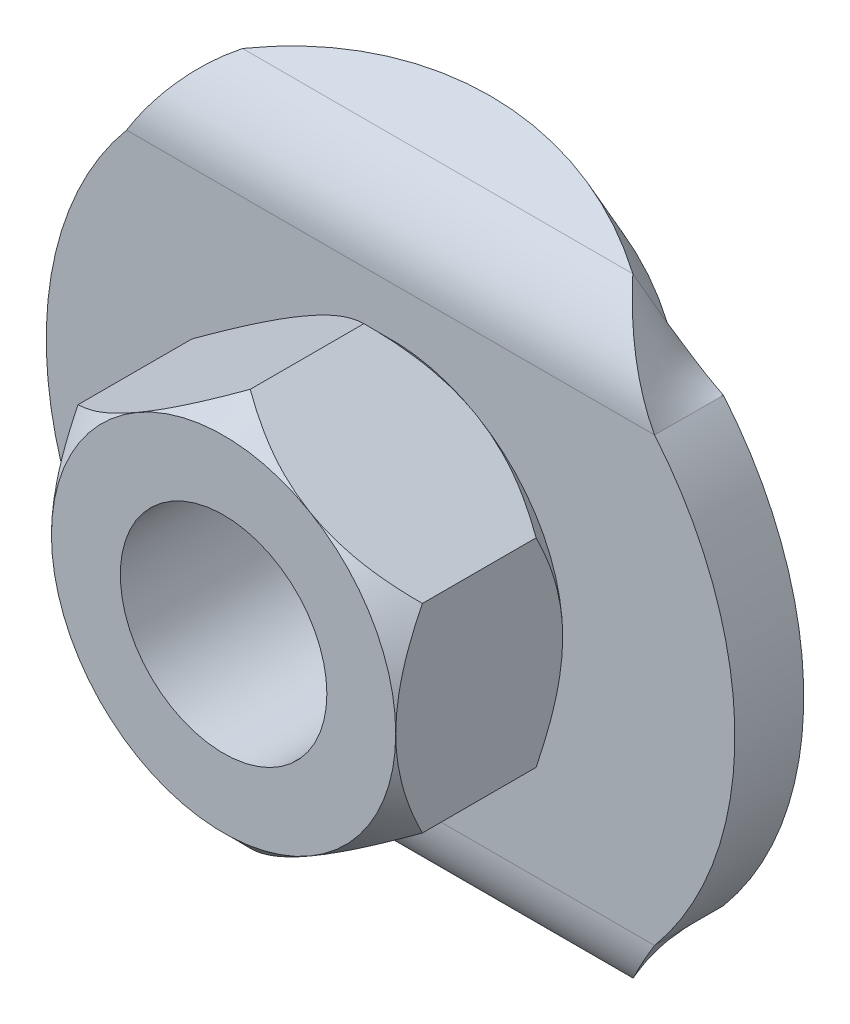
ISO-10303-21;
HEADER;
FILE_DESCRIPTION(('STEP AP214'),'2;1');
FILE_NAME('part.step','',(''),(''),'','','');
FILE_SCHEMA(('AUTOMOTIVE_DESIGN { 1 0 10303 214 1 1 1 1 }'));
ENDSEC;
DATA;
#1=APPLICATION_CONTEXT('core data for automotive mechanical design processes');
#2=APPLICATION_PROTOCOL_DEFINITION('international standard','automotive_design',2000,#1);
#3=PRODUCT_CONTEXT('',#1,'mechanical');
#4=PRODUCT('Part','Part','',(#3));
#5=PRODUCT_RELATED_PRODUCT_CATEGORY('part','',(#4));
#6=PRODUCT_DEFINITION_FORMATION('','',#4);
#7=PRODUCT_DEFINITION_CONTEXT('part definition',#1,'design');
#8=PRODUCT_DEFINITION('design','',#6,#7);
#9=PRODUCT_DEFINITION_SHAPE('','',#8);
#10=(LENGTH_UNIT() NAMED_UNIT(*) SI_UNIT(.MILLI.,.METRE.));
#11=(NAMED_UNIT(*) PLANE_ANGLE_UNIT() SI_UNIT($,.RADIAN.));
#12=(NAMED_UNIT(*) SI_UNIT($,.STERADIAN.) SOLID_ANGLE_UNIT());
#13=UNCERTAINTY_MEASURE_WITH_UNIT(LENGTH_MEASURE(1.E-05),#10,'distance_accuracy_value','');
#14=(GEOMETRIC_REPRESENTATION_CONTEXT(3) GLOBAL_UNCERTAINTY_ASSIGNED_CONTEXT((#13)) GLOBAL_UNIT_ASSIGNED_CONTEXT((#10,
#11,#12)) REPRESENTATION_CONTEXT('',''));
#15=CARTESIAN_POINT('',(0.,0.,0.));
#16=DIRECTION('',(0.,0.,1.));
#17=DIRECTION('',(1.,0.,0.));
#18=AXIS2_PLACEMENT_3D('',#15,#16,#17);
#19=CARTESIAN_POINT('',(0.,0.,6.07185629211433));
#20=DIRECTION('',(0.,0.,-1.));
#21=DIRECTION('',(-0.5,-0.866025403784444,0.));
#22=AXIS2_PLACEMENT_3D('',#19,#20,#21);
#23=CONICAL_SURFACE('',#22,5.77814370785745,0.785398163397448);
#24=CARTESIAN_POINT('',(-4.99999999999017,-2.88675134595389,6.07649730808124));
#25=CARTESIAN_POINT('',(-4.91348124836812,-2.93670297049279,6.12644123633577));
#26=CARTESIAN_POINT('',(-4.8262934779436,-2.98704085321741,6.17484266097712));
#27=CARTESIAN_POINT('',(-4.65044510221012,-3.08856696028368,6.26808914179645));
#28=CARTESIAN_POINT('',(-4.56178367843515,-3.1397556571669,6.31293213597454));
#29=CARTESIAN_POINT('',(-4.29247860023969,-3.29523901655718,6.44183821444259));
#30=CARTESIAN_POINT('',(-4.10953671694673,-3.40086056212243,6.51967475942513));
#31=CARTESIAN_POINT('',(-3.74304267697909,-3.61245599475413,6.65181312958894));
#32=CARTESIAN_POINT('',(-3.55966278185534,-3.7183304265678,6.70673320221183));
#33=CARTESIAN_POINT('',(-3.2816622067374,-3.87883413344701,6.77027051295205));
#34=CARTESIAN_POINT('',(-3.18862267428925,-3.93255053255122,6.78829854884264));
#35=CARTESIAN_POINT('',(-3.00176650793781,-4.04043199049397,6.81767507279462));
#36=CARTESIAN_POINT('',(-2.90795013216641,-4.09459690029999,6.82902569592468));
#37=CARTESIAN_POINT('',(-2.76179663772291,-4.17897865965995,6.8412304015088));
#38=CARTESIAN_POINT('',(-2.70960338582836,-4.20911244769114,6.8445079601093));
#39=CARTESIAN_POINT('',(-2.60494172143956,-4.26953888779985,6.84889831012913));
#40=CARTESIAN_POINT('',(-2.55247303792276,-4.29983169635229,6.8500024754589));
#41=CARTESIAN_POINT('',(-2.49999999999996,-4.33012701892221,6.84999999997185));
#42=B_SPLINE_CURVE_WITH_KNOTS('',3,(#24,#25,#26,#27,#28,#29,#30,#31,#32,#33,#34,#35,#36,#37,#38,
#39,#40,#41),.UNSPECIFIED.,.F.,.F.,(4,2,2,2,2,2,2,2,4),(0.,0.335055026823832,0.670302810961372,
1.34476662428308,1.99962838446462,2.32625984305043,2.65278680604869,2.83382184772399,
3.0155739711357),.UNSPECIFIED.);
#43=CARTESIAN_POINT('',(-4.99999999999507,-2.88675134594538,6.07649730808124));
#44=VERTEX_POINT('',#43);
#45=CARTESIAN_POINT('',(-2.49999999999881,-4.33012701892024,6.84999999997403));
#46=VERTEX_POINT('',#45);
#47=EDGE_CURVE('E454',#44,#46,#42,.T.);
#48=ORIENTED_EDGE('',*,*,#47,.T.);
#49=CARTESIAN_POINT('',(0.,0.,6.84999999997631));
#50=DIRECTION('',(0.,0.,-1.));
#51=DIRECTION('',(-0.5,-0.866025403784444,0.));
#52=AXIS2_PLACEMENT_3D('',#49,#50,#51);
#53=CIRCLE('',#52,4.99999999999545);
#54=CARTESIAN_POINT('',(-4.99999999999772,0.,6.84999999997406));
#55=VERTEX_POINT('',#54);
#56=EDGE_CURVE('E404',#55,#46,#53,.F.);
#57=ORIENTED_EDGE('',*,*,#56,.F.);
#58=CARTESIAN_POINT('',(-5.,0.,6.84999999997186));
#59=CARTESIAN_POINT('',(-5.,-0.0767946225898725,6.85000614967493));
#60=CARTESIAN_POINT('',(-5.,-0.153577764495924,6.84822988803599));
#61=CARTESIAN_POINT('',(-5.,-0.30697095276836,6.84117047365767));
#62=CARTESIAN_POINT('',(-5.,-0.383581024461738,6.83588787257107));
#63=CARTESIAN_POINT('',(-5.,-0.61266057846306,6.8148942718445));
#64=CARTESIAN_POINT('',(-5.,-0.76468394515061,6.79403701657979));
#65=CARTESIAN_POINT('',(-5.,-1.06412089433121,6.74011214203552));
#66=CARTESIAN_POINT('',(-4.99999999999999,-1.2115694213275,6.70723342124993));
#67=CARTESIAN_POINT('',(-5.,-1.5036687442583,6.63069544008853));
#68=CARTESIAN_POINT('',(-5.,-1.64831864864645,6.58703280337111));
#69=CARTESIAN_POINT('',(-5.,-1.88488502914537,6.50724434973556));
#70=CARTESIAN_POINT('',(-4.99999999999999,-1.97770630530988,6.47374942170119));
#71=CARTESIAN_POINT('',(-4.99999999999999,-2.16198936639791,6.40326206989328));
#72=CARTESIAN_POINT('',(-4.99999999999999,-2.25345143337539,6.36627038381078));
#73=CARTESIAN_POINT('',(-4.99999999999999,-2.43598892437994,6.28878280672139));
#74=CARTESIAN_POINT('',(-4.99999999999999,-2.52705057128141,6.24825463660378));
#75=CARTESIAN_POINT('',(-4.99999999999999,-2.70786670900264,6.16439142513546));
#76=CARTESIAN_POINT('',(-4.99999999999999,-2.79762128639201,6.1210565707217));
#77=CARTESIAN_POINT('',(-5.,-2.88675134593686,6.07649730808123));
#78=B_SPLINE_CURVE_WITH_KNOTS('',3,(#58,#59,#60,#61,#62,#63,#64,#65,#66,#67,#68,#69,#70,#71,#72,
#73,#74,#75,#76,#77),.UNSPECIFIED.,.F.,.F.,(4,2,2,2,2,2,2,2,2,4),(0.,0.230341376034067,
0.460646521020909,0.920346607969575,1.37311358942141,1.82602250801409,2.12199524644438,
2.41790568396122,2.71687590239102,3.01582622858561),.UNSPECIFIED.);
#79=EDGE_CURVE('E394',#55,#44,#78,.T.);
#80=ORIENTED_EDGE('',*,*,#79,.T.);
#81=EDGE_LOOP('',(#48,#57,#80));
#82=FACE_BOUND('',#81,.T.);
#83=ADVANCED_FACE('F16',(#82),#23,.T.);
#84=CARTESIAN_POINT('',(0.,0.,6.07185629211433));
#85=DIRECTION('',(0.,0.,-1.));
#86=DIRECTION('',(-0.5,-0.866025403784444,0.));
#87=AXIS2_PLACEMENT_3D('',#84,#85,#86);
#88=CONICAL_SURFACE('',#87,5.77814370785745,0.785398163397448);
#89=CARTESIAN_POINT('',(9.84216239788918E-12,-5.77350269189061,6.07649730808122));
#90=CARTESIAN_POINT('',(0.086518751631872,-5.72355106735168,6.12644123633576));
#91=CARTESIAN_POINT('',(0.173706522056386,-5.67321318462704,6.17484266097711));
#92=CARTESIAN_POINT('',(0.349554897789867,-5.57168707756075,6.26808914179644));
#93=CARTESIAN_POINT('',(0.438216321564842,-5.52049838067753,6.31293213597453));
#94=CARTESIAN_POINT('',(0.707521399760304,-5.36501502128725,6.44183821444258));
#95=CARTESIAN_POINT('',(0.890463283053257,-5.25939347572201,6.51967475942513));
#96=CARTESIAN_POINT('',(1.25695732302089,-5.0477980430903,6.65181312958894));
#97=CARTESIAN_POINT('',(1.44033721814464,-4.94192361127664,6.70673320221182));
#98=CARTESIAN_POINT('',(1.71833779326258,-4.78141990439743,6.77027051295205));
#99=CARTESIAN_POINT('',(1.81137732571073,-4.72770350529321,6.78829854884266));
#100=CARTESIAN_POINT('',(1.99823349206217,-4.61982204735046,6.81767507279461));
#101=CARTESIAN_POINT('',(2.09204986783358,-4.56565713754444,6.82902569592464));
#102=CARTESIAN_POINT('',(2.23820336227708,-4.48127537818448,6.84123040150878));
#103=CARTESIAN_POINT('',(2.29039661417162,-4.45114159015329,6.84450796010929));
#104=CARTESIAN_POINT('',(2.39505827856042,-4.39071515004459,6.84889831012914));
#105=CARTESIAN_POINT('',(2.4475269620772,-4.36042234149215,6.85000247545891));
#106=CARTESIAN_POINT('',(2.5,-4.33012701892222,6.84999999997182));
#107=B_SPLINE_CURVE_WITH_KNOTS('',3,(#89,#90,#91,#92,#93,#94,#95,#96,#97,#98,#99,#100,#101,#102,
#103,#104,#105,#106),.UNSPECIFIED.,.F.,.F.,(4,2,2,2,2,2,2,2,4),(0.,0.335055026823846,
0.670302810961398,1.34476662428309,1.99962838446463,2.32625984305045,2.65278680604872,
2.833821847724,3.0155739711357),.UNSPECIFIED.);
#108=CARTESIAN_POINT('',(0.,-5.77350269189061,6.07649730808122));
#109=VERTEX_POINT('',#108);
#110=CARTESIAN_POINT('',(2.4999999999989,-4.33012701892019,6.8499999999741));
#111=VERTEX_POINT('',#110);
#112=EDGE_CURVE('E468',#109,#111,#107,.T.);
#113=ORIENTED_EDGE('',*,*,#112,.T.);
#114=CARTESIAN_POINT('',(0.,0.,6.84999999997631));
#115=DIRECTION('',(0.,0.,-1.));
#116=DIRECTION('',(-0.5,-0.866025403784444,0.));
#117=AXIS2_PLACEMENT_3D('',#114,#115,#116);
#118=CIRCLE('',#117,4.99999999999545);
#119=EDGE_CURVE('E402',#46,#111,#118,.F.);
#120=ORIENTED_EDGE('',*,*,#119,.F.);
#121=CARTESIAN_POINT('',(-2.49999999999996,-4.33012701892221,6.84999999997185));
#122=CARTESIAN_POINT('',(-2.43349390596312,-4.36852433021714,6.85000614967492));
#123=CARTESIAN_POINT('',(-2.3669977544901,-4.40691590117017,6.84822988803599));
#124=CARTESIAN_POINT('',(-2.23415535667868,-4.48361249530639,6.84117047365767));
#125=CARTESIAN_POINT('',(-2.16780908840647,-4.52191753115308,6.83588787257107));
#126=CARTESIAN_POINT('',(-1.9694203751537,-4.63645730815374,6.8148942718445));
#127=CARTESIAN_POINT('',(-1.83776427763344,-4.71246899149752,6.79403701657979));
#128=CARTESIAN_POINT('',(-1.57844427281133,-4.86218746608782,6.74011214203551));
#129=CARTESIAN_POINT('',(-1.45075010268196,-4.93591172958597,6.7072334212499));
#130=CARTESIAN_POINT('',(-1.19778466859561,-5.08196139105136,6.63069544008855));
#131=CARTESIAN_POINT('',(-1.07251417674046,-5.15428634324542,6.5870328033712));
#132=CARTESIAN_POINT('',(-0.867641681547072,-5.27256953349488,6.50724434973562));
#133=CARTESIAN_POINT('',(-0.787256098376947,-5.31898017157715,6.4737494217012));
#134=CARTESIAN_POINT('',(-0.627662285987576,-5.41112170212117,6.40326206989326));
#135=CARTESIAN_POINT('',(-0.548453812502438,-5.4568527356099,6.36627038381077));
#136=CARTESIAN_POINT('',(-0.390371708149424,-5.54812148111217,6.28878280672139));
#137=CARTESIAN_POINT('',(-0.311510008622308,-5.59365230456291,6.24825463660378));
#138=CARTESIAN_POINT('',(-0.154918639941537,-5.68406037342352,6.16439142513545));
#139=CARTESIAN_POINT('',(-0.0771888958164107,-5.7289376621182,6.12105657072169));
#140=CARTESIAN_POINT('',(-9.75327398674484E-12,-5.77350269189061,6.07649730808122));
#141=B_SPLINE_CURVE_WITH_KNOTS('',3,(#121,#122,#123,#124,#125,#126,#127,#128,#129,#130,#131,
#132,#133,#134,#135,#136,#137,#138,#139,#140),.UNSPECIFIED.,.F.,.F.,(4,2,2,2,2,2,2,2,2,4),(0.,
0.230341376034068,0.460646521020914,0.920346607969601,1.37311358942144,1.82602250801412,
2.1219952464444,2.41790568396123,2.71687590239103,3.01582622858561),.UNSPECIFIED.);
#142=EDGE_CURVE('E462',#46,#109,#141,.T.);
#143=ORIENTED_EDGE('',*,*,#142,.T.);
#144=EDGE_LOOP('',(#113,#120,#143));
#145=FACE_BOUND('',#144,.T.);
#146=ADVANCED_FACE('F467',(#145),#88,.T.);
#147=CARTESIAN_POINT('',(0.,0.,6.07185629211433));
#148=DIRECTION('',(0.,0.,-1.));
#149=DIRECTION('',(-0.5,-0.866025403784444,0.));
#150=AXIS2_PLACEMENT_3D('',#147,#148,#149);
#151=CONICAL_SURFACE('',#150,5.77814370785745,0.785398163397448);
#152=CARTESIAN_POINT('',(0.,0.,6.84999999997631));
#153=DIRECTION('',(0.,0.,-1.));
#154=DIRECTION('',(-0.5,-0.866025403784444,0.));
#155=AXIS2_PLACEMENT_3D('',#152,#153,#154);
#156=CIRCLE('',#155,4.99999999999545);
#157=CARTESIAN_POINT('',(4.99999999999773,0.,6.8499999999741));
#158=VERTEX_POINT('',#157);
#159=EDGE_CURVE('E400',#111,#158,#156,.F.);
#160=ORIENTED_EDGE('',*,*,#159,.F.);
#161=CARTESIAN_POINT('',(2.5,-4.33012701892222,6.84999999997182));
#162=CARTESIAN_POINT('',(2.56650609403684,-4.2917297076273,6.85000614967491));
#163=CARTESIAN_POINT('',(2.63300224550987,-4.25333813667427,6.84822988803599));
#164=CARTESIAN_POINT('',(2.7658446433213,-4.17664154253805,6.84117047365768));
#165=CARTESIAN_POINT('',(2.83219091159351,-4.13833650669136,6.83588787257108));
#166=CARTESIAN_POINT('',(3.03057962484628,-4.02379672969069,6.8148942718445));
#167=CARTESIAN_POINT('',(3.16223572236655,-3.94778504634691,6.7940370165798));
#168=CARTESIAN_POINT('',(3.42155572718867,-3.7980665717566,6.74011214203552));
#169=CARTESIAN_POINT('',(3.54924989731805,-3.72434230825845,6.70723342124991));
#170=CARTESIAN_POINT('',(3.80221533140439,-3.57829264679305,6.63069544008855));
#171=CARTESIAN_POINT('',(3.92748582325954,-3.50596769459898,6.58703280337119));
#172=CARTESIAN_POINT('',(4.13235831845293,-3.38768450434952,6.50724434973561));
#173=CARTESIAN_POINT('',(4.21274390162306,-3.34127386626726,6.4737494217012));
#174=CARTESIAN_POINT('',(4.37233771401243,-3.24913233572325,6.40326206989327));
#175=CARTESIAN_POINT('',(4.45154618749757,-3.20340130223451,6.36627038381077));
#176=CARTESIAN_POINT('',(4.60962829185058,-3.11213255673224,6.28878280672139));
#177=CARTESIAN_POINT('',(4.68848999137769,-3.0666017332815,6.24825463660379));
#178=CARTESIAN_POINT('',(4.84508136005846,-2.9761936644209,6.16439142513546));
#179=CARTESIAN_POINT('',(4.92281110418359,-2.93131637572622,6.12105657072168));
#180=CARTESIAN_POINT('',(4.99999999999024,-2.88675134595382,6.0764973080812));
#181=B_SPLINE_CURVE_WITH_KNOTS('',3,(#161,#162,#163,#164,#165,#166,#167,#168,#169,#170,#171,
#172,#173,#174,#175,#176,#177,#178,#179,#180),.UNSPECIFIED.,.F.,.F.,(4,2,2,2,2,2,2,2,2,4),(0.,
0.230341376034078,0.460646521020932,0.920346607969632,1.37311358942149,1.82602250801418,
2.12199524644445,2.41790568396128,2.71687590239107,3.01582622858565),.UNSPECIFIED.);
#182=CARTESIAN_POINT('',(4.99999999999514,-2.88675134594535,6.0764973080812));
#183=VERTEX_POINT('',#182);
#184=EDGE_CURVE('E458',#111,#183,#181,.T.);
#185=ORIENTED_EDGE('',*,*,#184,.T.);
#186=CARTESIAN_POINT('',(5.,-2.88675134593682,6.07649730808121));
#187=CARTESIAN_POINT('',(5.00000000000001,-2.78684809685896,6.12644123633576));
#188=CARTESIAN_POINT('',(5.00000000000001,-2.68617233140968,6.17484266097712));
#189=CARTESIAN_POINT('',(5.00000000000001,-2.4831201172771,6.26808914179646));
#190=CARTESIAN_POINT('',(5.00000000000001,-2.38074272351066,6.31293213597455));
#191=CARTESIAN_POINT('',(5.00000000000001,-2.0697760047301,6.44183821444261));
#192=CARTESIAN_POINT('',(5.00000000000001,-1.85853291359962,6.51967475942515));
#193=CARTESIAN_POINT('',(5.,-1.43534204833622,6.65181312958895));
#194=CARTESIAN_POINT('',(5.,-1.22359318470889,6.70673320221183));
#195=CARTESIAN_POINT('',(5.,-0.902585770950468,6.77027051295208));
#196=CARTESIAN_POINT('',(5.,-0.795152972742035,6.7882985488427));
#197=CARTESIAN_POINT('',(5.,-0.579390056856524,6.81767507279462));
#198=CARTESIAN_POINT('',(5.,-0.471060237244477,6.8290256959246));
#199=CARTESIAN_POINT('',(5.,-0.302296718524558,6.84123040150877));
#200=CARTESIAN_POINT('',(5.,-0.242029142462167,6.84450796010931));
#201=CARTESIAN_POINT('',(5.,-0.121176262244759,6.84889831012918));
#202=CARTESIAN_POINT('',(5.,-0.0605906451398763,6.85000247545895));
#203=CARTESIAN_POINT('',(5.,0.,6.84999999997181));
#204=B_SPLINE_CURVE_WITH_KNOTS('',3,(#186,#187,#188,#189,#190,#191,#192,#193,#194,#195,#196,
#197,#198,#199,#200,#201,#202,#203),.UNSPECIFIED.,.F.,.F.,(4,2,2,2,2,2,2,2,4),(0.,
0.335055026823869,0.670302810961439,1.3447666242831,1.99962838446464,2.32625984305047,
2.65278680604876,2.83382184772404,3.01557397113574),.UNSPECIFIED.);
#205=EDGE_CURVE('E446',#183,#158,#204,.T.);
#206=ORIENTED_EDGE('',*,*,#205,.T.);
#207=EDGE_LOOP('',(#160,#185,#206));
#208=FACE_BOUND('',#207,.T.);
#209=ADVANCED_FACE('F478',(#208),#151,.T.);
#210=CARTESIAN_POINT('',(0.,0.,6.07185629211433));
#211=DIRECTION('',(0.,0.,-1.));
#212=DIRECTION('',(-0.5,-0.866025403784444,0.));
#213=AXIS2_PLACEMENT_3D('',#210,#211,#212);
#214=CONICAL_SURFACE('',#213,5.77814370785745,0.785398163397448);
#215=CARTESIAN_POINT('',(4.99999999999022,2.88675134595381,6.07649730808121));
#216=CARTESIAN_POINT('',(4.91348124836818,2.93670297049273,6.12644123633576));
#217=CARTESIAN_POINT('',(4.82629347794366,2.98704085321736,6.17484266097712));
#218=CARTESIAN_POINT('',(4.65044510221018,3.08856696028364,6.26808914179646));
#219=CARTESIAN_POINT('',(4.5617836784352,3.13975565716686,6.31293213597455));
#220=CARTESIAN_POINT('',(4.29247860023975,3.29523901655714,6.4418382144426));
#221=CARTESIAN_POINT('',(4.1095367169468,3.40086056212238,6.51967475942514));
#222=CARTESIAN_POINT('',(3.74304267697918,3.61245599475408,6.65181312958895));
#223=CARTESIAN_POINT('',(3.55966278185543,3.71833042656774,6.70673320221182));
#224=CARTESIAN_POINT('',(3.28166220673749,3.87883413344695,6.77027051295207));
#225=CARTESIAN_POINT('',(3.18862267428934,3.93255053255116,6.78829854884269));
#226=CARTESIAN_POINT('',(3.0017665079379,4.04043199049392,6.81767507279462));
#227=CARTESIAN_POINT('',(2.90795013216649,4.09459690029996,6.82902569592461));
#228=CARTESIAN_POINT('',(2.76179663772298,4.17897865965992,6.84123040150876));
#229=CARTESIAN_POINT('',(2.70960338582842,4.20911244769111,6.8445079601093));
#230=CARTESIAN_POINT('',(2.6049417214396,4.26953888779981,6.84889831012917));
#231=CARTESIAN_POINT('',(2.5524730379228,4.29983169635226,6.85000247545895));
#232=CARTESIAN_POINT('',(2.5,4.3301270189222,6.84999999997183));
#233=B_SPLINE_CURVE_WITH_KNOTS('',3,(#215,#216,#217,#218,#219,#220,#221,#222,#223,#224,#225,
#226,#227,#228,#229,#230,#231,#232),.UNSPECIFIED.,.F.,.F.,(4,2,2,2,2,2,2,2,4),(0.,
0.335055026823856,0.670302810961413,1.34476662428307,1.9996283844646,2.32625984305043,
2.65278680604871,2.83382184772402,3.01557397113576),.UNSPECIFIED.);
#234=CARTESIAN_POINT('',(4.99999999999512,2.88675134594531,6.0764973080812));
#235=VERTEX_POINT('',#234);
#236=CARTESIAN_POINT('',(2.49999999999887,4.33012701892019,6.84999999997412));
#237=VERTEX_POINT('',#236);
#238=EDGE_CURVE('E418',#235,#237,#233,.T.);
#239=ORIENTED_EDGE('',*,*,#238,.T.);
#240=CARTESIAN_POINT('',(0.,0.,6.84999999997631));
#241=DIRECTION('',(0.,0.,-1.));
#242=DIRECTION('',(-0.5,-0.866025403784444,0.));
#243=AXIS2_PLACEMENT_3D('',#240,#241,#242);
#244=CIRCLE('',#243,4.99999999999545);
#245=EDGE_CURVE('E20',#158,#237,#244,.F.);
#246=ORIENTED_EDGE('',*,*,#245,.F.);
#247=CARTESIAN_POINT('',(5.,0.,6.84999999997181));
#248=CARTESIAN_POINT('',(5.,0.0767946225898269,6.85000614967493));
#249=CARTESIAN_POINT('',(5.,0.153577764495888,6.84822988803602));
#250=CARTESIAN_POINT('',(5.,0.306970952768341,6.84117047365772));
#251=CARTESIAN_POINT('',(5.,0.383581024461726,6.83588787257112));
#252=CARTESIAN_POINT('',(5.,0.612660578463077,6.81489427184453));
#253=CARTESIAN_POINT('',(5.,0.764683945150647,6.79403701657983));
#254=CARTESIAN_POINT('',(5.,1.06412089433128,6.74011214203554));
#255=CARTESIAN_POINT('',(4.99999999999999,1.21156942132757,6.70723342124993));
#256=CARTESIAN_POINT('',(5.,1.50366874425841,6.63069544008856));
#257=CARTESIAN_POINT('',(5.,1.64831864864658,6.58703280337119));
#258=CARTESIAN_POINT('',(5.,1.8848850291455,6.50724434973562));
#259=CARTESIAN_POINT('',(4.99999999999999,1.97770630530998,6.47374942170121));
#260=CARTESIAN_POINT('',(4.99999999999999,2.16198936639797,6.40326206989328));
#261=CARTESIAN_POINT('',(4.99999999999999,2.25345143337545,6.36627038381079));
#262=CARTESIAN_POINT('',(4.99999999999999,2.43598892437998,6.28878280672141));
#263=CARTESIAN_POINT('',(4.99999999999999,2.52705057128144,6.24825463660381));
#264=CARTESIAN_POINT('',(4.99999999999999,2.70786670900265,6.16439142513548));
#265=CARTESIAN_POINT('',(4.99999999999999,2.797621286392,6.12105657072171));
#266=CARTESIAN_POINT('',(5.,2.88675134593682,6.07649730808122));
#267=B_SPLINE_CURVE_WITH_KNOTS('',3,(#247,#248,#249,#250,#251,#252,#253,#254,#255,#256,#257,
#258,#259,#260,#261,#262,#263,#264,#265,#266),.UNSPECIFIED.,.F.,.F.,(4,2,2,2,2,2,2,2,2,4),(0.,
0.230341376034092,0.460646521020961,0.920346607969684,1.37311358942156,1.82602250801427,
2.12199524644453,2.41790568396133,2.7168759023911,3.01582622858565),.UNSPECIFIED.);
#268=EDGE_CURVE('E422',#158,#235,#267,.T.);
#269=ORIENTED_EDGE('',*,*,#268,.T.);
#270=EDGE_LOOP('',(#239,#246,#269));
#271=FACE_BOUND('',#270,.T.);
#272=ADVANCED_FACE('F420',(#271),#214,.T.);
#273=CARTESIAN_POINT('',(0.,0.,6.07185629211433));
#274=DIRECTION('',(0.,0.,-1.));
#275=DIRECTION('',(-0.5,-0.866025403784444,0.));
#276=AXIS2_PLACEMENT_3D('',#273,#274,#275);
#277=CONICAL_SURFACE('',#276,5.77814370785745,0.785398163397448);
#278=CARTESIAN_POINT('',(-9.79359014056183E-12,5.7735026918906,6.07649730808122));
#279=CARTESIAN_POINT('',(-0.086518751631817,5.72355106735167,6.12644123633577));
#280=CARTESIAN_POINT('',(-0.173706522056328,5.67321318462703,6.17484266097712));
#281=CARTESIAN_POINT('',(-0.349554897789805,5.57168707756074,6.26808914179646));
#282=CARTESIAN_POINT('',(-0.438216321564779,5.52049838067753,6.31293213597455));
#283=CARTESIAN_POINT('',(-0.70752139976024,5.36501502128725,6.4418382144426));
#284=CARTESIAN_POINT('',(-0.890463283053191,5.259393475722,6.51967475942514));
#285=CARTESIAN_POINT('',(-1.25695732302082,5.0477980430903,6.65181312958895));
#286=CARTESIAN_POINT('',(-1.44033721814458,4.94192361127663,6.70673320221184));
#287=CARTESIAN_POINT('',(-1.71833779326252,4.78141990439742,6.77027051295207));
#288=CARTESIAN_POINT('',(-1.81137732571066,4.72770350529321,6.78829854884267));
#289=CARTESIAN_POINT('',(-1.99823349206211,4.61982204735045,6.81767507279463));
#290=CARTESIAN_POINT('',(-2.09204986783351,4.56565713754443,6.82902569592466));
#291=CARTESIAN_POINT('',(-2.23820336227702,4.48127537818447,6.8412304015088));
#292=CARTESIAN_POINT('',(-2.29039661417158,4.45114159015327,6.84450796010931));
#293=CARTESIAN_POINT('',(-2.39505827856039,4.39071515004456,6.84889831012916));
#294=CARTESIAN_POINT('',(-2.44752696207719,4.36042234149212,6.85000247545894));
#295=CARTESIAN_POINT('',(-2.5,4.33012701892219,6.84999999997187));
#296=B_SPLINE_CURVE_WITH_KNOTS('',3,(#278,#279,#280,#281,#282,#283,#284,#285,#286,#287,#288,
#289,#290,#291,#292,#293,#294,#295),.UNSPECIFIED.,.F.,.F.,(4,2,2,2,2,2,2,2,4),(0.,
0.335055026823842,0.670302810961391,1.34476662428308,1.99962838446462,2.32625984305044,
2.65278680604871,2.83382184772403,3.01557397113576),.UNSPECIFIED.);
#297=CARTESIAN_POINT('',(-4.89473104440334E-12,5.7735026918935,6.07649730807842));
#298=VERTEX_POINT('',#297);
#299=CARTESIAN_POINT('',(-2.49999999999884,4.33012701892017,6.84999999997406));
#300=VERTEX_POINT('',#299);
#301=EDGE_CURVE('E316',#298,#300,#296,.T.);
#302=ORIENTED_EDGE('',*,*,#301,.T.);
#303=CARTESIAN_POINT('',(0.,0.,6.84999999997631));
#304=DIRECTION('',(0.,0.,-1.));
#305=DIRECTION('',(-0.5,-0.866025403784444,0.));
#306=AXIS2_PLACEMENT_3D('',#303,#304,#305);
#307=CIRCLE('',#306,4.99999999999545);
#308=EDGE_CURVE('E407',#237,#300,#307,.F.);
#309=ORIENTED_EDGE('',*,*,#308,.F.);
#310=CARTESIAN_POINT('',(2.5,4.3301270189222,6.84999999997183));
#311=CARTESIAN_POINT('',(2.43349390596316,4.36852433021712,6.85000614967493));
#312=CARTESIAN_POINT('',(2.36699775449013,4.40691590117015,6.84822988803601));
#313=CARTESIAN_POINT('',(2.2341553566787,4.48361249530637,6.84117047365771));
#314=CARTESIAN_POINT('',(2.16780908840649,4.52191753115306,6.8358878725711));
#315=CARTESIAN_POINT('',(1.96942037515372,4.63645730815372,6.81489427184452));
#316=CARTESIAN_POINT('',(1.83776427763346,4.71246899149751,6.79403701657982));
#317=CARTESIAN_POINT('',(1.57844427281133,4.8621874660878,6.74011214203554));
#318=CARTESIAN_POINT('',(1.45075010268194,4.93591172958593,6.70723342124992));
#319=CARTESIAN_POINT('',(1.19778466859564,5.08196139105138,6.63069544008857));
#320=CARTESIAN_POINT('',(1.07251417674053,5.15428634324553,6.58703280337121));
#321=CARTESIAN_POINT('',(0.867641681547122,5.27256953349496,6.50724434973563));
#322=CARTESIAN_POINT('',(0.787256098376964,5.31898017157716,6.47374942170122));
#323=CARTESIAN_POINT('',(0.627662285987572,5.41112170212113,6.40326206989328));
#324=CARTESIAN_POINT('',(0.548453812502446,5.45685273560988,6.36627038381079));
#325=CARTESIAN_POINT('',(0.390371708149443,5.54812148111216,6.28878280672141));
#326=CARTESIAN_POINT('',(0.311510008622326,5.59365230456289,6.24825463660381));
#327=CARTESIAN_POINT('',(0.15491863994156,5.6840603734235,6.16439142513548));
#328=CARTESIAN_POINT('',(0.0771888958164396,5.72893766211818,6.1210565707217));
#329=CARTESIAN_POINT('',(9.80184624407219E-12,5.7735026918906,6.07649730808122));
#330=B_SPLINE_CURVE_WITH_KNOTS('',3,(#310,#311,#312,#313,#314,#315,#316,#317,#318,#319,#320,
#321,#322,#323,#324,#325,#326,#327,#328,#329),.UNSPECIFIED.,.F.,.F.,(4,2,2,2,2,2,2,2,2,4),(0.,
0.230341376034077,0.46064652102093,0.920346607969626,1.37311358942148,1.82602250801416,
2.12199524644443,2.41790568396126,2.71687590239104,3.01582622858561),.UNSPECIFIED.);
#331=EDGE_CURVE('E430',#237,#298,#330,.T.);
#332=ORIENTED_EDGE('',*,*,#331,.T.);
#333=EDGE_LOOP('',(#302,#309,#332));
#334=FACE_BOUND('',#333,.T.);
#335=ADVANCED_FACE('F435',(#334),#277,.T.);
#336=CARTESIAN_POINT('',(0.,0.,6.07185629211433));
#337=DIRECTION('',(0.,0.,-1.));
#338=DIRECTION('',(-0.5,-0.866025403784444,0.));
#339=AXIS2_PLACEMENT_3D('',#336,#337,#338);
#340=CONICAL_SURFACE('',#339,5.77814370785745,0.785398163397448);
#341=CARTESIAN_POINT('',(-5.,2.88675134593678,6.07649730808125));
#342=CARTESIAN_POINT('',(-5.00000000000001,2.78684809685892,6.12644123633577));
#343=CARTESIAN_POINT('',(-5.00000000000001,2.68617233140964,6.17484266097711));
#344=CARTESIAN_POINT('',(-5.00000000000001,2.48312011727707,6.26808914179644));
#345=CARTESIAN_POINT('',(-5.00000000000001,2.38074272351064,6.31293213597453));
#346=CARTESIAN_POINT('',(-5.00000000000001,2.06977600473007,6.44183821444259));
#347=CARTESIAN_POINT('',(-5.00000000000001,1.85853291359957,6.51967475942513));
#348=CARTESIAN_POINT('',(-5.00000000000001,1.43534204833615,6.65181312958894));
#349=CARTESIAN_POINT('',(-5.,1.22359318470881,6.70673320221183));
#350=CARTESIAN_POINT('',(-5.,0.902585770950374,6.77027051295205));
#351=CARTESIAN_POINT('',(-5.,0.795152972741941,6.78829854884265));
#352=CARTESIAN_POINT('',(-5.,0.57939005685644,6.81767507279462));
#353=CARTESIAN_POINT('',(-5.,0.471060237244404,6.82902569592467));
#354=CARTESIAN_POINT('',(-5.,0.302296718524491,6.84123040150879));
#355=CARTESIAN_POINT('',(-5.,0.2420291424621,6.84450796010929));
#356=CARTESIAN_POINT('',(-5.,0.121176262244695,6.84889831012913));
#357=CARTESIAN_POINT('',(-5.,0.0605906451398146,6.85000247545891));
#358=CARTESIAN_POINT('',(-5.,0.,6.84999999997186));
#359=B_SPLINE_CURVE_WITH_KNOTS('',3,(#341,#342,#343,#344,#345,#346,#347,#348,#349,#350,#351,
#352,#353,#354,#355,#356,#357,#358),.UNSPECIFIED.,.F.,.F.,(4,2,2,2,2,2,2,2,4),(0.,
0.335055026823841,0.67030281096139,1.3447666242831,1.99962838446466,2.32625984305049,
2.65278680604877,2.83382184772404,3.01557397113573),.UNSPECIFIED.);
#360=CARTESIAN_POINT('',(-5.,2.88675134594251,6.07649730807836));
#361=VERTEX_POINT('',#360);
#362=EDGE_CURVE('E385',#361,#55,#359,.T.);
#363=ORIENTED_EDGE('',*,*,#362,.T.);
#364=CARTESIAN_POINT('',(0.,0.,6.84999999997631));
#365=DIRECTION('',(0.,0.,-1.));
#366=DIRECTION('',(-0.5,-0.866025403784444,0.));
#367=AXIS2_PLACEMENT_3D('',#364,#365,#366);
#368=CIRCLE('',#367,4.99999999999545);
#369=EDGE_CURVE('E406',#300,#55,#368,.F.);
#370=ORIENTED_EDGE('',*,*,#369,.F.);
#371=CARTESIAN_POINT('',(-2.5,4.33012701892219,6.84999999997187));
#372=CARTESIAN_POINT('',(-2.56650609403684,4.29172970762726,6.85000614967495));
#373=CARTESIAN_POINT('',(-2.63300224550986,4.25333813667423,6.84822988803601));
#374=CARTESIAN_POINT('',(-2.76584464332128,4.17664154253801,6.8411704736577));
#375=CARTESIAN_POINT('',(-2.8321909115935,4.13833650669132,6.8358878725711));
#376=CARTESIAN_POINT('',(-3.03057962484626,4.02379672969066,6.81489427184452));
#377=CARTESIAN_POINT('',(-3.16223572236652,3.94778504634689,6.79403701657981));
#378=CARTESIAN_POINT('',(-3.42155572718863,3.79806657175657,6.74011214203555));
#379=CARTESIAN_POINT('',(-3.549249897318,3.72434230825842,6.70723342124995));
#380=CARTESIAN_POINT('',(-3.80221533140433,3.57829264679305,6.63069544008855));
#381=CARTESIAN_POINT('',(-3.92748582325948,3.50596769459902,6.58703280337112));
#382=CARTESIAN_POINT('',(-4.13235831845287,3.38768450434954,6.50724434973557));
#383=CARTESIAN_POINT('',(-4.21274390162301,3.34127386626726,6.47374942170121));
#384=CARTESIAN_POINT('',(-4.37233771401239,3.24913233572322,6.4032620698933));
#385=CARTESIAN_POINT('',(-4.45154618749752,3.20340130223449,6.3662703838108));
#386=CARTESIAN_POINT('',(-4.60962829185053,3.11213255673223,6.28878280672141));
#387=CARTESIAN_POINT('',(-4.68848999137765,3.06660173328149,6.24825463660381));
#388=CARTESIAN_POINT('',(-4.84508136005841,2.97619366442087,6.16439142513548));
#389=CARTESIAN_POINT('',(-4.92281110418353,2.93131637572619,6.12105657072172));
#390=CARTESIAN_POINT('',(-4.99999999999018,2.88675134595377,6.07649730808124));
#391=B_SPLINE_CURVE_WITH_KNOTS('',3,(#371,#372,#373,#374,#375,#376,#377,#378,#379,#380,#381,
#382,#383,#384,#385,#386,#387,#388,#389,#390),.UNSPECIFIED.,.F.,.F.,(4,2,2,2,2,2,2,2,2,4),(0.,
0.230341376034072,0.460646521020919,0.920346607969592,1.37311358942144,1.82602250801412,
2.1219952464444,2.41790568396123,2.71687590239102,3.01582622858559),.UNSPECIFIED.);
#392=EDGE_CURVE('E440',#300,#361,#391,.T.);
#393=ORIENTED_EDGE('',*,*,#392,.T.);
#394=EDGE_LOOP('',(#363,#370,#393));
#395=FACE_BOUND('',#394,.T.);
#396=ADVANCED_FACE('F305',(#395),#340,.T.);
#397=CARTESIAN_POINT('',(-2.5,4.33012701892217,6.85000000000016));
#398=DIRECTION('',(0.5,-0.866025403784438,0.));
#399=DIRECTION('',(0.866025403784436,0.5,0.));
#400=AXIS2_PLACEMENT_3D('',#397,#398,#399);
#401=PLANE('',#400);
#402=DIRECTION('',(0.,0.,1.));
#403=VECTOR('',#402,1.);
#404=CARTESIAN_POINT('',(0.,5.77350269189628,6.85000000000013));
#405=LINE('',#404,#403);
#406=CARTESIAN_POINT('',(-3.06568583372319E-08,5.77350267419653,2.77350267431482));
#407=VERTEX_POINT('',#406);
#408=EDGE_CURVE('E433',#298,#407,#405,.F.);
#409=ORIENTED_EDGE('',*,*,#408,.T.);
#410=CARTESIAN_POINT('',(-2.50000000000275,4.33012701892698,2.00000000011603));
#411=CARTESIAN_POINT('',(-2.43349390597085,4.36852433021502,1.99999385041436));
#412=CARTESIAN_POINT('',(-2.36699775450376,4.40691590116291,2.00177011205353));
#413=CARTESIAN_POINT('',(-2.23415535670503,4.48361249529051,2.00882952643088));
#414=CARTESIAN_POINT('',(-2.16780908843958,4.52191753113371,2.01411212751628));
#415=CARTESIAN_POINT('',(-1.9694203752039,4.63645730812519,2.03510572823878));
#416=CARTESIAN_POINT('',(-1.8377642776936,4.71246899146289,2.0559629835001));
#417=CARTESIAN_POINT('',(-1.57844427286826,4.86218746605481,2.10988785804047));
#418=CARTESIAN_POINT('',(-1.45075010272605,4.93591172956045,2.14276657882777));
#419=CARTESIAN_POINT('',(-1.19778466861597,5.08196139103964,2.21930455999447));
#420=CARTESIAN_POINT('',(-1.07251417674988,5.15428634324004,2.26296719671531));
#421=CARTESIAN_POINT('',(-0.867641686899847,5.27256953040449,2.34275564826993));
#422=CARTESIAN_POINT('',(-0.787256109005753,5.3189801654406,2.37625057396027));
#423=CARTESIAN_POINT('',(-0.627662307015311,5.41112168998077,2.44673792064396));
#424=CARTESIAN_POINT('',(-0.548453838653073,5.45685272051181,2.48372960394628));
#425=CARTESIAN_POINT('',(-0.390371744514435,5.54812146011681,2.56121717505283));
#426=CARTESIAN_POINT('',(-0.311510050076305,5.59365228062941,2.60174534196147));
#427=CARTESIAN_POINT('',(-0.154918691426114,5.68406034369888,2.68560854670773));
#428=CARTESIAN_POINT('',(-0.0771889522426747,5.72893762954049,2.72894339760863));
#429=CARTESIAN_POINT('',(-6.13130581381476E-08,5.7735026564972,2.77350265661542));
#430=B_SPLINE_CURVE_WITH_KNOTS('',3,(#410,#411,#412,#413,#414,#415,#416,#417,#418,#419,#420,
#421,#422,#423,#424,#425,#426,#427,#428,#429),.UNSPECIFIED.,.F.,.F.,(4,2,2,2,2,2,2,2,2,4),(0.,
0.230341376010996,0.460646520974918,0.920346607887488,1.37311358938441,1.82602250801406,
2.12199522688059,2.41790564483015,2.71687584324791,3.01582614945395),.UNSPECIFIED.);
#431=CARTESIAN_POINT('',(-2.5,4.33012701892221,2.00000000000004));
#432=VERTEX_POINT('',#431);
#433=EDGE_CURVE('E287',#432,#407,#430,.T.);
#434=ORIENTED_EDGE('',*,*,#433,.F.);
#435=CARTESIAN_POINT('',(-4.99999999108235,2.88675131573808,2.77350271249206));
#436=CARTESIAN_POINT('',(-4.91348125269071,2.93670295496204,2.72355877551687));
#437=CARTESIAN_POINT('',(-4.82629348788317,2.98704084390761,2.6751573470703));
#438=CARTESIAN_POINT('',(-4.65044511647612,3.08856695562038,2.58191086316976));
#439=CARTESIAN_POINT('',(-4.56178369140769,3.13975565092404,2.53706786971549));
#440=CARTESIAN_POINT('',(-4.29247861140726,3.29523900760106,2.4081617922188));
#441=CARTESIAN_POINT('',(-4.10953672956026,3.4008605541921,2.33032524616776));
#442=CARTESIAN_POINT('',(-3.74304269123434,3.61245598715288,2.19818687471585));
#443=CARTESIAN_POINT('',(-3.55966279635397,3.71833041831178,2.14326680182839));
#444=CARTESIAN_POINT('',(-3.2816622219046,3.87883412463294,2.07972949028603));
#445=CARTESIAN_POINT('',(-3.1886226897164,3.93255052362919,2.06170145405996));
#446=CARTESIAN_POINT('',(-3.00176652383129,4.04043198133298,2.03232492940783));
#447=CARTESIAN_POINT('',(-2.90795014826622,4.09459689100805,2.02097430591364));
#448=CARTESIAN_POINT('',(-2.76179665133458,4.17897865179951,2.00876959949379));
#449=CARTESIAN_POINT('',(-2.70960339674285,4.20911244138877,2.00549204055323));
#450=CARTESIAN_POINT('',(-2.60494172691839,4.26953888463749,2.00110169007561));
#451=CARTESIAN_POINT('',(-2.55247304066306,4.29983169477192,1.99999752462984));
#452=CARTESIAN_POINT('',(-2.49999999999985,4.33012701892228,2.00000000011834));
#453=B_SPLINE_CURVE_WITH_KNOTS('',3,(#435,#436,#437,#438,#439,#440,#441,#442,#443,#444,#445,
#446,#447,#448,#449,#450,#451,#452),.UNSPECIFIED.,.F.,.F.,(4,2,2,2,2,2,2,2,4),(0.,
0.335055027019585,0.67030281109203,1.34476662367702,1.99962838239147,2.32625984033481,
2.65278680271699,2.83382185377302,3.01557398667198),.UNSPECIFIED.);
#454=CARTESIAN_POINT('',(-5.,2.88675131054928,2.77350267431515));
#455=VERTEX_POINT('',#454);
#456=EDGE_CURVE('E326',#455,#432,#453,.T.);
#457=ORIENTED_EDGE('',*,*,#456,.F.);
#458=DIRECTION('',(0.,0.,1.));
#459=VECTOR('',#458,1.);
#460=CARTESIAN_POINT('',(-5.,2.88675134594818,6.85));
#461=LINE('',#460,#459);
#462=EDGE_CURVE('E437',#361,#455,#461,.F.);
#463=ORIENTED_EDGE('',*,*,#462,.F.);
#464=ORIENTED_EDGE('',*,*,#392,.F.);
#465=ORIENTED_EDGE('',*,*,#301,.F.);
#466=EDGE_LOOP('',(#409,#434,#457,#463,#464,#465));
#467=FACE_BOUND('',#466,.T.);
#468=ADVANCED_FACE('F301',(#467),#401,.F.);
#469=CARTESIAN_POINT('',(-5.,0.,6.85));
#470=DIRECTION('',(1.,0.,0.));
#471=DIRECTION('',(0.,1.,0.));
#472=AXIS2_PLACEMENT_3D('',#469,#470,#471);
#473=PLANE('',#472);
#474=ORIENTED_EDGE('',*,*,#462,.T.);
#475=CARTESIAN_POINT('',(-5.00000000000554,0.,2.00000000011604));
#476=CARTESIAN_POINT('',(-5.00000000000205,0.0767946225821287,1.99999385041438));
#477=CARTESIAN_POINT('',(-5.00000000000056,0.15357776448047,2.00177011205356));
#478=CARTESIAN_POINT('',(-4.99999999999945,0.3069709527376,2.00882952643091));
#479=CARTESIAN_POINT('',(-4.99999999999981,0.383581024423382,2.01411212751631));
#480=CARTESIAN_POINT('',(-5.0000000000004,0.612660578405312,2.0351057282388));
#481=CARTESIAN_POINT('',(-5.00000000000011,0.764683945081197,2.05596298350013));
#482=CARTESIAN_POINT('',(-4.99999999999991,1.0641208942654,2.1098878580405));
#483=CARTESIAN_POINT('',(-4.99999999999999,1.21156942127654,2.1427665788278));
#484=CARTESIAN_POINT('',(-5.00000000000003,1.50366874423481,2.2193045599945));
#485=CARTESIAN_POINT('',(-5.,1.64831864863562,2.26296719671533));
#486=CARTESIAN_POINT('',(-5.,1.88488502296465,2.34275564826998));
#487=CARTESIAN_POINT('',(-5.00000000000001,1.977706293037,2.37625057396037));
#488=CARTESIAN_POINT('',(-5.00000000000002,2.16198934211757,2.44673792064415));
#489=CARTESIAN_POINT('',(-5.00000000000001,2.25345140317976,2.48372960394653));
#490=CARTESIAN_POINT('',(-5.00000000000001,2.43598888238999,2.56121717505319));
#491=CARTESIAN_POINT('',(-5.00000000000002,2.5270505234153,2.60174534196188));
#492=CARTESIAN_POINT('',(-5.00000000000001,2.70786664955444,2.68560854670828));
#493=CARTESIAN_POINT('',(-5.00000000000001,2.79762122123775,2.72894339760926));
#494=CARTESIAN_POINT('',(-5.,2.88675127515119,2.77350265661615));
#495=B_SPLINE_CURVE_WITH_KNOTS('',3,(#475,#476,#477,#478,#479,#480,#481,#482,#483,#484,#485,
#486,#487,#488,#489,#490,#491,#492,#493,#494),.UNSPECIFIED.,.F.,.F.,(4,2,2,2,2,2,2,2,2,4),(0.,
0.230341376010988,0.460646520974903,0.920346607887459,1.37311358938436,1.826022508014,
2.12199522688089,2.41790564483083,2.71687584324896,3.01582614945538),.UNSPECIFIED.);
#496=CARTESIAN_POINT('',(-5.,0.,2.));
#497=VERTEX_POINT('',#496);
#498=EDGE_CURVE('E334',#497,#455,#495,.T.);
#499=ORIENTED_EDGE('',*,*,#498,.F.);
#500=CARTESIAN_POINT('',(-4.99999996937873,-2.88675135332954,2.77350271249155));
#501=CARTESIAN_POINT('',(-4.9999999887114,-2.786848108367,2.72355877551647));
#502=CARTESIAN_POINT('',(-4.99999999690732,-2.6861723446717,2.67515734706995));
#503=CARTESIAN_POINT('',(-5.00000000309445,-2.48312013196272,2.58191086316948));
#504=CARTESIAN_POINT('',(-5.00000000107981,-2.38074273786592,2.53706786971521));
#505=CARTESIAN_POINT('',(-4.99999999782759,-2.06977601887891,2.40816179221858));
#506=CARTESIAN_POINT('',(-4.99999999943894,-1.85853292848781,2.33032524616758));
#507=CARTESIAN_POINT('',(-5.00000000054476,-1.4353420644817,2.19818687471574));
#508=CARTESIAN_POINT('',(-5.0000000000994,-1.22359320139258,2.14326680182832));
#509=CARTESIAN_POINT('',(-4.99999999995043,-0.902585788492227,2.07972949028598));
#510=CARTESIAN_POINT('',(-4.99999999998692,-0.795152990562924,2.06170145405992));
#511=CARTESIAN_POINT('',(-5.00000000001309,-0.579390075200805,2.03232492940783));
#512=CARTESIAN_POINT('',(-5.00000000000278,-0.471060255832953,2.02097430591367));
#513=CARTESIAN_POINT('',(-4.99999999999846,-0.302296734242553,2.00876959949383));
#514=CARTESIAN_POINT('',(-4.99999999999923,-0.242029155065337,2.00549204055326));
#515=CARTESIAN_POINT('',(-5.00000000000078,-0.121176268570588,2.00110169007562));
#516=CARTESIAN_POINT('',(-5.00000000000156,-0.0605906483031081,1.99999752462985));
#517=CARTESIAN_POINT('',(-5.,1.76831622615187E-13,2.00000000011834));
#518=B_SPLINE_CURVE_WITH_KNOTS('',3,(#500,#501,#502,#503,#504,#505,#506,#507,#508,#509,#510,
#511,#512,#513,#514,#515,#516,#517),.UNSPECIFIED.,.F.,.F.,(4,2,2,2,2,2,2,2,4),(0.,
0.335055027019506,0.670302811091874,1.34476662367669,1.999628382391,2.32625984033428,
2.65278680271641,2.8338218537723,3.01557398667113),.UNSPECIFIED.);
#519=CARTESIAN_POINT('',(-4.99999996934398,-2.88675136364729,2.77350267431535));
#520=VERTEX_POINT('',#519);
#521=EDGE_CURVE('E363',#520,#497,#518,.T.);
#522=ORIENTED_EDGE('',*,*,#521,.F.);
#523=DIRECTION('',(0.,0.,1.));
#524=VECTOR('',#523,1.);
#525=CARTESIAN_POINT('',(-5.,-2.88675134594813,6.85));
#526=LINE('',#525,#524);
#527=EDGE_CURVE('E459',#520,#44,#526,.T.);
#528=ORIENTED_EDGE('',*,*,#527,.T.);
#529=ORIENTED_EDGE('',*,*,#79,.F.);
#530=ORIENTED_EDGE('',*,*,#362,.F.);
#531=EDGE_LOOP('',(#474,#499,#522,#528,#529,#530));
#532=FACE_BOUND('',#531,.T.);
#533=ADVANCED_FACE('F304',(#532),#473,.F.);
#534=CARTESIAN_POINT('',(0.,0.,2.77814370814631));
#535=DIRECTION('',(0.,0.,1.));
#536=DIRECTION('',(0.5,0.866025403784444,0.));
#537=AXIS2_PLACEMENT_3D('',#534,#535,#536);
#538=CONICAL_SURFACE('',#537,5.77814370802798,0.785398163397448);
#539=ORIENTED_EDGE('',*,*,#498,.T.);
#540=ORIENTED_EDGE('',*,*,#456,.T.);
#541=CARTESIAN_POINT('',(0.,0.,2.));
#542=DIRECTION('',(0.,0.,-1.));
#543=DIRECTION('',(-1.,0.,0.));
#544=AXIS2_PLACEMENT_3D('',#541,#542,#543);
#545=CIRCLE('',#544,4.99999999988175);
#546=EDGE_CURVE('E514',#497,#432,#545,.T.);
#547=ORIENTED_EDGE('',*,*,#546,.F.);
#548=EDGE_LOOP('',(#539,#540,#547));
#549=FACE_BOUND('',#548,.T.);
#550=ADVANCED_FACE('F348',(#549),#538,.T.);
#551=CARTESIAN_POINT('',(-2.49999999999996,-4.33012701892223,6.85000000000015));
#552=DIRECTION('',(0.5,0.866025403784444,0.));
#553=DIRECTION('',(-0.866025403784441,0.5,0.));
#554=AXIS2_PLACEMENT_3D('',#551,#552,#553);
#555=PLANE('',#554);
#556=ORIENTED_EDGE('',*,*,#527,.F.);
#557=CARTESIAN_POINT('',(-2.50000000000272,-4.330127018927,2.00000000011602));
#558=CARTESIAN_POINT('',(-2.56650609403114,-4.29172970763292,1.99999385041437));
#559=CARTESIAN_POINT('',(-2.63300224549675,-4.25333813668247,2.00177011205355));
#560=CARTESIAN_POINT('',(-2.76584464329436,-4.17664154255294,2.0088295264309));
#561=CARTESIAN_POINT('',(-2.83219091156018,-4.13833650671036,2.0141121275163));
#562=CARTESIAN_POINT('',(-3.03057962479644,-4.0237967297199,2.03510572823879));
#563=CARTESIAN_POINT('',(-3.16223572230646,-3.94778504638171,2.05596298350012));
#564=CARTESIAN_POINT('',(-3.42155572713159,-3.79806657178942,2.10988785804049));
#565=CARTESIAN_POINT('',(-3.54924989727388,-3.7243423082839,2.14276657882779));
#566=CARTESIAN_POINT('',(-3.80221533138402,-3.57829264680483,2.2193045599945));
#567=CARTESIAN_POINT('',(-3.92748582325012,-3.50596769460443,2.26296719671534));
#568=CARTESIAN_POINT('',(-4.13235831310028,-3.38768450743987,2.34275564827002));
#569=CARTESIAN_POINT('',(-4.21274389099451,-3.34127387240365,2.37625057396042));
#570=CARTESIAN_POINT('',(-4.37233769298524,-3.24913234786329,2.44673792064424));
#571=CARTESIAN_POINT('',(-4.45154616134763,-3.20340131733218,2.48372960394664));
#572=CARTESIAN_POINT('',(-4.60962825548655,-3.11213257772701,2.56121717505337));
#573=CARTESIAN_POINT('',(-4.68848994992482,-3.06660175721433,2.60174534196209));
#574=CARTESIAN_POINT('',(-4.84508130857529,-2.9761936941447,2.68560854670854));
#575=CARTESIAN_POINT('',(-4.92281104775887,-2.931316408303,2.72894339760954));
#576=CARTESIAN_POINT('',(-4.99999993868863,-2.88675138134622,2.77350265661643));
#577=B_SPLINE_CURVE_WITH_KNOTS('',3,(#557,#558,#559,#560,#561,#562,#563,#564,#565,#566,#567,
#568,#569,#570,#571,#572,#573,#574,#575,#576),.UNSPECIFIED.,.F.,.F.,(4,2,2,2,2,2,2,2,2,4),(0.,
0.230341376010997,0.460646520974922,0.920346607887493,1.37311358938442,1.82602250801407,
2.12199522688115,2.41790564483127,2.71687584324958,3.01582614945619),.UNSPECIFIED.);
#578=CARTESIAN_POINT('',(-2.5,-4.33012701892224,2.));
#579=VERTEX_POINT('',#578);
#580=EDGE_CURVE('E333',#579,#520,#577,.T.);
#581=ORIENTED_EDGE('',*,*,#580,.F.);
#582=CARTESIAN_POINT('',(2.1702836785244E-08,-5.77350266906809,2.77350271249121));
#583=CARTESIAN_POINT('',(-0.0865187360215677,-5.72355106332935,2.72355877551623));
#584=CARTESIAN_POINT('',(-0.173706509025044,-5.67321318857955,2.67515734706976));
#585=CARTESIAN_POINT('',(-0.349554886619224,-5.57168708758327,2.58191086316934));
#586=CARTESIAN_POINT('',(-0.438216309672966,-5.52049838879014,2.53706786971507));
#587=CARTESIAN_POINT('',(-0.707521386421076,-5.36501502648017,2.40816179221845));
#588=CARTESIAN_POINT('',(-0.890463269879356,-5.25939348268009,2.33032524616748));
#589=CARTESIAN_POINT('',(-1.256957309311,-5.04779805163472,2.19818687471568));
#590=CARTESIAN_POINT('',(-1.44033720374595,-4.94192361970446,2.14326680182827));
#591=CARTESIAN_POINT('',(-1.71833777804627,-4.78141991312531,2.07972949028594));
#592=CARTESIAN_POINT('',(-1.81137731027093,-4.72770351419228,2.06170145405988));
#593=CARTESIAN_POINT('',(-1.99823347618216,-4.61982205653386,2.03232492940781));
#594=CARTESIAN_POINT('',(-2.09204985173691,-4.56565714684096,2.02097430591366));
#595=CARTESIAN_POINT('',(-2.23820334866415,-4.48127538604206,2.00876959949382));
#596=CARTESIAN_POINT('',(-2.2903966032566,-4.45114159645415,2.00549204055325));
#597=CARTESIAN_POINT('',(-2.39505827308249,-4.39071515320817,2.00110169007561));
#598=CARTESIAN_POINT('',(-2.44752695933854,-4.36042234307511,1.99999752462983));
#599=CARTESIAN_POINT('',(-2.50000000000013,-4.33012701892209,2.00000000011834));
#600=B_SPLINE_CURVE_WITH_KNOTS('',3,(#582,#583,#584,#585,#586,#587,#588,#589,#590,#591,#592,
#593,#594,#595,#596,#597,#598,#599),.UNSPECIFIED.,.F.,.F.,(4,2,2,2,2,2,2,2,4),(0.,
0.335055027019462,0.670302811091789,1.34476662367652,1.99962838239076,2.32625984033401,
2.6527868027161,2.83382185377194,3.01557398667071),.UNSPECIFIED.);
#601=CARTESIAN_POINT('',(3.0655834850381E-08,-5.7735026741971,2.77350267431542));
#602=VERTEX_POINT('',#601);
#603=EDGE_CURVE('E534',#602,#579,#600,.T.);
#604=ORIENTED_EDGE('',*,*,#603,.F.);
#605=DIRECTION('',(0.,0.,1.));
#606=VECTOR('',#605,1.);
#607=CARTESIAN_POINT('',(0.,-5.77350269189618,6.85000000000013));
#608=LINE('',#607,#606);
#609=EDGE_CURVE('E464',#602,#109,#608,.T.);
#610=ORIENTED_EDGE('',*,*,#609,.T.);
#611=ORIENTED_EDGE('',*,*,#142,.F.);
#612=ORIENTED_EDGE('',*,*,#47,.F.);
#613=EDGE_LOOP('',(#556,#581,#604,#610,#611,#612));
#614=FACE_BOUND('',#613,.T.);
#615=ADVANCED_FACE('F351',(#614),#555,.F.);
#616=CARTESIAN_POINT('',(0.,0.,2.77814370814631));
#617=DIRECTION('',(0.,0.,1.));
#618=DIRECTION('',(0.5,0.866025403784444,0.));
#619=AXIS2_PLACEMENT_3D('',#616,#617,#618);
#620=CONICAL_SURFACE('',#619,5.77814370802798,0.785398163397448);
#621=ORIENTED_EDGE('',*,*,#580,.T.);
#622=ORIENTED_EDGE('',*,*,#521,.T.);
#623=CARTESIAN_POINT('',(0.,0.,2.));
#624=DIRECTION('',(0.,0.,-1.));
#625=DIRECTION('',(-1.,0.,0.));
#626=AXIS2_PLACEMENT_3D('',#623,#624,#625);
#627=CIRCLE('',#626,4.99999999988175);
#628=EDGE_CURVE('E521',#579,#497,#627,.T.);
#629=ORIENTED_EDGE('',*,*,#628,.F.);
#630=EDGE_LOOP('',(#621,#622,#629));
#631=FACE_BOUND('',#630,.T.);
#632=ADVANCED_FACE('F353',(#631),#620,.T.);
#633=CARTESIAN_POINT('',(2.5,-4.33012701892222,6.85000000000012));
#634=DIRECTION('',(-0.5,0.866025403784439,0.));
#635=DIRECTION('',(-0.866025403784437,-0.5,0.));
#636=AXIS2_PLACEMENT_3D('',#633,#634,#635);
#637=PLANE('',#636);
#638=ORIENTED_EDGE('',*,*,#609,.F.);
#639=CARTESIAN_POINT('',(2.50000000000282,-4.33012701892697,2.00000000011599));
#640=CARTESIAN_POINT('',(2.43349390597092,-4.368524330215,1.99999385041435));
#641=CARTESIAN_POINT('',(2.36699775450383,-4.4069159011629,2.00177011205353));
#642=CARTESIAN_POINT('',(2.2341553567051,-4.4836124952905,2.00882952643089));
#643=CARTESIAN_POINT('',(2.16780908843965,-4.52191753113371,2.01411212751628));
#644=CARTESIAN_POINT('',(1.96942037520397,-4.63645730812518,2.03510572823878));
#645=CARTESIAN_POINT('',(1.83776427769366,-4.71246899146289,2.0559629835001));
#646=CARTESIAN_POINT('',(1.57844427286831,-4.86218746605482,2.10988785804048));
#647=CARTESIAN_POINT('',(1.4507501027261,-4.93591172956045,2.14276657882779));
#648=CARTESIAN_POINT('',(1.19778466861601,-5.08196139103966,2.21930455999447));
#649=CARTESIAN_POINT('',(1.07251417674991,-5.15428634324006,2.26296719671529));
#650=CARTESIAN_POINT('',(0.867641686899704,-5.27256953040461,2.34275564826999));
#651=CARTESIAN_POINT('',(0.787256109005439,-5.31898016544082,2.37625057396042));
#652=CARTESIAN_POINT('',(0.627662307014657,-5.41112168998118,2.44673792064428));
#653=CARTESIAN_POINT('',(0.548453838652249,-5.45685272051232,2.48372960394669));
#654=CARTESIAN_POINT('',(0.390371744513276,-5.54812146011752,2.56121717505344));
#655=CARTESIAN_POINT('',(0.311510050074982,-5.59365228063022,2.60174534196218));
#656=CARTESIAN_POINT('',(0.154918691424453,-5.68406034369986,2.68560854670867));
#657=CARTESIAN_POINT('',(0.0771889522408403,-5.72893762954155,2.7289433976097));
#658=CARTESIAN_POINT('',(6.13110354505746E-08,-5.77350265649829,2.77350265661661));
#659=B_SPLINE_CURVE_WITH_KNOTS('',3,(#639,#640,#641,#642,#643,#644,#645,#646,#647,#648,#649,
#650,#651,#652,#653,#654,#655,#656,#657,#658),.UNSPECIFIED.,.F.,.F.,(4,2,2,2,2,2,2,2,2,4),(0.,
0.230341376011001,0.460646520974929,0.920346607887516,1.37311358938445,1.82602250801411,
2.12199522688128,2.41790564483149,2.7168758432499,3.01582614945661),.UNSPECIFIED.);
#660=CARTESIAN_POINT('',(2.49999999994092,-4.33012701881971,2.00000000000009));
#661=VERTEX_POINT('',#660);
#662=EDGE_CURVE('E370',#661,#602,#659,.T.);
#663=ORIENTED_EDGE('',*,*,#662,.F.);
#664=CARTESIAN_POINT('',(4.99999993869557,-2.88675138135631,2.7735026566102));
#665=CARTESIAN_POINT('',(4.91348118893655,-2.93670300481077,2.72355873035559));
#666=CARTESIAN_POINT('',(4.82629342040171,-2.98704088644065,2.67515730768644));
#667=CARTESIAN_POINT('',(4.65044504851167,-3.08856699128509,2.58191083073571));
#668=CARTESIAN_POINT('',(4.56178362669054,-3.13975568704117,2.53706783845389));
#669=CARTESIAN_POINT('',(4.29247855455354,-3.29523904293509,2.4081617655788));
#670=CARTESIAN_POINT('',(4.10953667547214,-3.40086058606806,2.33032522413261));
#671=CARTESIAN_POINT('',(3.74304264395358,-3.61245601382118,2.19818686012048));
#672=CARTESIAN_POINT('',(3.55966275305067,-3.71833044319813,2.14326679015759));
#673=CARTESIAN_POINT('',(3.28166218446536,-3.87883414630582,2.07972948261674));
#674=CARTESIAN_POINT('',(3.18862265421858,-3.93255054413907,2.06170144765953));
#675=CARTESIAN_POINT('',(3.00176649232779,-4.0404319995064,2.03232492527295));
#676=CARTESIAN_POINT('',(2.90795011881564,-4.09459690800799,2.0209743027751));
#677=CARTESIAN_POINT('',(2.76179662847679,-4.17897866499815,2.00876959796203));
#678=CARTESIAN_POINT('',(2.70960337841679,-4.2091124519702,2.00549203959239));
#679=CARTESIAN_POINT('',(2.60494171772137,-4.26953888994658,2.00110168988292));
#680=CARTESIAN_POINT('',(2.55247303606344,-4.29983169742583,1.99999752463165));
#681=CARTESIAN_POINT('',(2.49999999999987,-4.3301270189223,2.0000000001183));
#682=B_SPLINE_CURVE_WITH_KNOTS('',3,(#664,#665,#666,#667,#668,#669,#670,#671,#672,#673,#674,
#675,#676,#677,#678,#679,#680,#681),.UNSPECIFIED.,.F.,.F.,(4,2,2,2,2,2,2,2,4),(0.,
0.335055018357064,0.67030279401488,1.34476659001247,1.99962833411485,2.32625978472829,
2.6527867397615,2.83382177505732,3.01557389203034),.UNSPECIFIED.);
#683=CARTESIAN_POINT('',(5.,-2.88675135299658,2.7735026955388));
#684=VERTEX_POINT('',#683);
#685=EDGE_CURVE('E536',#684,#661,#682,.T.);
#686=ORIENTED_EDGE('',*,*,#685,.F.);
#687=DIRECTION('',(0.,0.,1.));
#688=VECTOR('',#687,1.);
#689=CARTESIAN_POINT('',(5.,-2.88675134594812,6.8500000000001));
#690=LINE('',#689,#688);
#691=EDGE_CURVE('E474',#684,#183,#690,.T.);
#692=ORIENTED_EDGE('',*,*,#691,.T.);
#693=ORIENTED_EDGE('',*,*,#184,.F.);
#694=ORIENTED_EDGE('',*,*,#112,.F.);
#695=EDGE_LOOP('',(#638,#663,#686,#692,#693,#694));
#696=FACE_BOUND('',#695,.T.);
#697=ADVANCED_FACE('F358',(#696),#637,.F.);
#698=CARTESIAN_POINT('',(0.,0.,2.77814370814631));
#699=DIRECTION('',(0.,0.,1.));
#700=DIRECTION('',(0.5,0.866025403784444,0.));
#701=AXIS2_PLACEMENT_3D('',#698,#699,#700);
#702=CONICAL_SURFACE('',#701,5.77814370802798,0.785398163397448);
#703=ORIENTED_EDGE('',*,*,#662,.T.);
#704=ORIENTED_EDGE('',*,*,#603,.T.);
#705=CARTESIAN_POINT('',(0.,0.,2.));
#706=DIRECTION('',(0.,0.,-1.));
#707=DIRECTION('',(-1.,0.,0.));
#708=AXIS2_PLACEMENT_3D('',#705,#706,#707);
#709=CIRCLE('',#708,4.99999999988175);
#710=EDGE_CURVE('E523',#661,#579,#709,.T.);
#711=ORIENTED_EDGE('',*,*,#710,.F.);
#712=EDGE_LOOP('',(#703,#704,#711));
#713=FACE_BOUND('',#712,.T.);
#714=ADVANCED_FACE('F360',(#713),#702,.T.);
#715=CARTESIAN_POINT('',(5.,0.,6.8500000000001));
#716=DIRECTION('',(-1.,0.,0.));
#717=DIRECTION('',(0.,-1.,0.));
#718=AXIS2_PLACEMENT_3D('',#715,#716,#717);
#719=PLANE('',#718);
#720=ORIENTED_EDGE('',*,*,#691,.F.);
#721=CARTESIAN_POINT('',(5.00000000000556,0.,2.00000000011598));
#722=CARTESIAN_POINT('',(5.00000000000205,-0.07679462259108,1.99999385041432));
#723=CARTESIAN_POINT('',(5.00000000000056,-0.153577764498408,2.00177011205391));
#724=CARTESIAN_POINT('',(4.99999999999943,-0.306970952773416,2.00882952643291));
#725=CARTESIAN_POINT('',(4.9999999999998,-0.38358102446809,2.01411212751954));
#726=CARTESIAN_POINT('',(5.00000000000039,-0.612660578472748,2.03510572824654));
#727=CARTESIAN_POINT('',(5.0000000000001,-0.764683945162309,2.05596298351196));
#728=CARTESIAN_POINT('',(4.9999999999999,-1.06412089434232,2.10988785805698));
#729=CARTESIAN_POINT('',(4.99999999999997,-1.21156942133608,2.14276657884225));
#730=CARTESIAN_POINT('',(5.00000000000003,-1.5036687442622,2.21930456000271));
#731=CARTESIAN_POINT('',(5.00000000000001,-1.64831864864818,2.26296719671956));
#732=CARTESIAN_POINT('',(5.,-1.88488503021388,2.34275565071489));
#733=CARTESIAN_POINT('',(5.,-1.97770630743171,2.37625057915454));
#734=CARTESIAN_POINT('',(5.,-2.16198937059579,2.44673793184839));
#735=CARTESIAN_POINT('',(5.,-2.25345143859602,2.48372961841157));
#736=CARTESIAN_POINT('',(5.,-2.43598893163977,2.56121719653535));
#737=CARTESIAN_POINT('',(5.,-2.5270505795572,2.60174536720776));
#738=CARTESIAN_POINT('',(5.,-2.70786671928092,2.6856085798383));
#739=CARTESIAN_POINT('',(5.,-2.79762129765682,2.72894343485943));
#740=CARTESIAN_POINT('',(5.,-2.88675135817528,2.7735026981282));
#741=B_SPLINE_CURVE_WITH_KNOTS('',3,(#721,#722,#723,#724,#725,#726,#727,#728,#729,#730,#731,
#732,#733,#734,#735,#736,#737,#738,#739,#740),.UNSPECIFIED.,.F.,.F.,(4,2,2,2,2,2,2,2,2,4),(0.,
0.230341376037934,0.460646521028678,0.920346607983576,1.37311358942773,1.8260225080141,
2.12199524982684,2.41790569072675,2.71687591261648,3.01582624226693),.UNSPECIFIED.);
#742=CARTESIAN_POINT('',(5.,0.,2.00000000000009));
#743=VERTEX_POINT('',#742);
#744=EDGE_CURVE('E537',#743,#684,#741,.T.);
#745=ORIENTED_EDGE('',*,*,#744,.F.);
#746=CARTESIAN_POINT('',(4.99999996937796,2.88675135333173,2.77350271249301));
#747=CARTESIAN_POINT('',(4.99999998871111,2.78684810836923,2.72355877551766));
#748=CARTESIAN_POINT('',(4.99999999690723,2.68617234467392,2.67515734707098));
#749=CARTESIAN_POINT('',(5.00000000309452,2.48312013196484,2.58191086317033));
#750=CARTESIAN_POINT('',(5.00000000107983,2.38074273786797,2.53706786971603));
#751=CARTESIAN_POINT('',(4.99999999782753,2.06977601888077,2.40816179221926));
#752=CARTESIAN_POINT('',(4.99999999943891,1.85853292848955,2.33032524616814));
#753=CARTESIAN_POINT('',(5.00000000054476,1.43534206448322,2.1981868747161));
#754=CARTESIAN_POINT('',(5.00000000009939,1.22359320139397,2.1432668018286));
#755=CARTESIAN_POINT('',(4.99999999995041,0.90258578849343,2.07972949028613));
#756=CARTESIAN_POINT('',(4.9999999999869,0.795152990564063,2.06170145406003));
#757=CARTESIAN_POINT('',(5.00000000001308,0.579390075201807,2.0323249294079));
#758=CARTESIAN_POINT('',(5.00000000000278,0.471060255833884,2.02097430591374));
#759=CARTESIAN_POINT('',(4.99999999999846,0.302296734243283,2.00876959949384));
#760=CARTESIAN_POINT('',(4.99999999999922,0.242029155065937,2.00549204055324));
#761=CARTESIAN_POINT('',(5.00000000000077,0.121176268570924,2.00110169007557));
#762=CARTESIAN_POINT('',(5.00000000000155,0.0605906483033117,1.99999752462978));
#763=CARTESIAN_POINT('',(5.,-1.07442683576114E-13,2.00000000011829));
#764=B_SPLINE_CURVE_WITH_KNOTS('',3,(#746,#747,#748,#749,#750,#751,#752,#753,#754,#755,#756,
#757,#758,#759,#760,#761,#762,#763),.UNSPECIFIED.,.F.,.F.,(4,2,2,2,2,2,2,2,4),(0.,
0.335055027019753,0.67030281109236,1.34476662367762,1.99962838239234,2.32625984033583,
2.65278680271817,2.83382185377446,3.01557398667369),.UNSPECIFIED.);
#765=CARTESIAN_POINT('',(4.99999996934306,2.88675136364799,2.7735026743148));
#766=VERTEX_POINT('',#765);
#767=EDGE_CURVE('E294',#766,#743,#764,.T.);
#768=ORIENTED_EDGE('',*,*,#767,.F.);
#769=DIRECTION('',(0.,0.,1.));
#770=VECTOR('',#769,1.);
#771=CARTESIAN_POINT('',(5.,2.88675134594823,6.85000000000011));
#772=LINE('',#771,#770);
#773=EDGE_CURVE('E426',#766,#235,#772,.T.);
#774=ORIENTED_EDGE('',*,*,#773,.T.);
#775=ORIENTED_EDGE('',*,*,#268,.F.);
#776=ORIENTED_EDGE('',*,*,#205,.F.);
#777=EDGE_LOOP('',(#720,#745,#768,#774,#775,#776));
#778=FACE_BOUND('',#777,.T.);
#779=ADVANCED_FACE('F310',(#778),#719,.F.);
#780=CARTESIAN_POINT('',(0.,0.,2.77814370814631));
#781=DIRECTION('',(0.,0.,1.));
#782=DIRECTION('',(0.5,0.866025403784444,0.));
#783=AXIS2_PLACEMENT_3D('',#780,#781,#782);
#784=CONICAL_SURFACE('',#783,5.77814370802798,0.785398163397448);
#785=CARTESIAN_POINT('',(0.,0.,2.));
#786=DIRECTION('',(0.,0.,-1.));
#787=DIRECTION('',(-1.,0.,0.));
#788=AXIS2_PLACEMENT_3D('',#785,#786,#787);
#789=CIRCLE('',#788,4.99999999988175);
#790=EDGE_CURVE('E39',#743,#661,#789,.T.);
#791=ORIENTED_EDGE('',*,*,#790,.F.);
#792=ORIENTED_EDGE('',*,*,#744,.T.);
#793=ORIENTED_EDGE('',*,*,#685,.T.);
#794=EDGE_LOOP('',(#791,#792,#793));
#795=FACE_BOUND('',#794,.T.);
#796=ADVANCED_FACE('F553',(#795),#784,.T.);
#797=CARTESIAN_POINT('',(2.5,4.3301270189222,6.85000000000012));
#798=DIRECTION('',(-0.5,-0.866025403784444,0.));
#799=DIRECTION('',(0.866025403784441,-0.5,0.));
#800=AXIS2_PLACEMENT_3D('',#797,#798,#799);
#801=PLANE('',#800);
#802=ORIENTED_EDGE('',*,*,#773,.F.);
#803=CARTESIAN_POINT('',(2.5000000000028,4.33012701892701,2.00000000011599));
#804=CARTESIAN_POINT('',(2.56650609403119,4.2917297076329,1.99999385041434));
#805=CARTESIAN_POINT('',(2.6330022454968,4.25333813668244,2.00177011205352));
#806=CARTESIAN_POINT('',(2.7658446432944,4.1766415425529,2.00882952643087));
#807=CARTESIAN_POINT('',(2.83219091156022,4.13833650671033,2.01411212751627));
#808=CARTESIAN_POINT('',(3.03057962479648,4.02379672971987,2.03510572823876));
#809=CARTESIAN_POINT('',(3.16223572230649,3.94778504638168,2.05596298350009));
#810=CARTESIAN_POINT('',(3.42155572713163,3.79806657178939,2.10988785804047));
#811=CARTESIAN_POINT('',(3.54924989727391,3.72434230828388,2.14276657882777));
#812=CARTESIAN_POINT('',(3.80221533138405,3.5782926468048,2.21930455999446));
#813=CARTESIAN_POINT('',(3.92748582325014,3.50596769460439,2.26296719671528));
#814=CARTESIAN_POINT('',(4.13235831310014,3.38768450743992,2.3427556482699));
#815=CARTESIAN_POINT('',(4.21274389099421,3.34127387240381,2.37625057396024));
#816=CARTESIAN_POINT('',(4.37233769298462,3.24913234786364,2.44673792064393));
#817=CARTESIAN_POINT('',(4.45154616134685,3.20340131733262,2.48372960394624));
#818=CARTESIAN_POINT('',(4.60962825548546,3.11213257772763,2.56121717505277));
#819=CARTESIAN_POINT('',(4.68848994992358,3.06660175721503,2.60174534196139));
#820=CARTESIAN_POINT('',(4.84508130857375,2.9761936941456,2.68560854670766));
#821=CARTESIAN_POINT('',(4.92281104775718,2.93131640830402,2.72894339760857));
#822=CARTESIAN_POINT('',(4.99999993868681,2.88675138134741,2.7735026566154));
#823=B_SPLINE_CURVE_WITH_KNOTS('',3,(#803,#804,#805,#806,#807,#808,#809,#810,#811,#812,#813,
#814,#815,#816,#817,#818,#819,#820,#821,#822),.UNSPECIFIED.,.F.,.F.,(4,2,2,2,2,2,2,2,2,4),(0.,
0.230341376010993,0.460646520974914,0.920346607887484,1.3731135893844,1.82602250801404,
2.12199522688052,2.41790564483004,2.71687584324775,3.01582614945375),.UNSPECIFIED.);
#824=CARTESIAN_POINT('',(2.5,4.33012701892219,2.));
#825=VERTEX_POINT('',#824);
#826=EDGE_CURVE('E867',#825,#766,#823,.T.);
#827=ORIENTED_EDGE('',*,*,#826,.F.);
#828=CARTESIAN_POINT('',(-2.17051578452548E-08,5.7735026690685,2.77350271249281));
#829=CARTESIAN_POINT('',(0.0865187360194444,5.72355106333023,2.72355877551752));
#830=CARTESIAN_POINT('',(0.173706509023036,5.67321318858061,2.67515734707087));
#831=CARTESIAN_POINT('',(0.349554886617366,5.57168708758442,2.58191086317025));
#832=CARTESIAN_POINT('',(0.438216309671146,5.52049838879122,2.53706786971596));
#833=CARTESIAN_POINT('',(0.707521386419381,5.36501502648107,2.4081617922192));
#834=CARTESIAN_POINT('',(0.890463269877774,5.25939348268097,2.3303252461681));
#835=CARTESIAN_POINT('',(1.25695730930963,5.04779805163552,2.19818687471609));
#836=CARTESIAN_POINT('',(1.44033720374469,4.9419236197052,2.14326680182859));
#837=CARTESIAN_POINT('',(1.71833777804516,4.78141991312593,2.07972949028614));
#838=CARTESIAN_POINT('',(1.81137731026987,4.72770351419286,2.06170145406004));
#839=CARTESIAN_POINT('',(1.99823347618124,4.6198220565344,2.03232492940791));
#840=CARTESIAN_POINT('',(2.09204985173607,4.56565714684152,2.02097430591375));
#841=CARTESIAN_POINT('',(2.23820334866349,4.48127538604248,2.00876959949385));
#842=CARTESIAN_POINT('',(2.29039660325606,4.45114159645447,2.00549204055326));
#843=CARTESIAN_POINT('',(2.39505827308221,4.3907151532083,2.00110169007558));
#844=CARTESIAN_POINT('',(2.44752695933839,4.36042234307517,1.99999752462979));
#845=CARTESIAN_POINT('',(2.50000000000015,4.3301270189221,2.0000000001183));
#846=B_SPLINE_CURVE_WITH_KNOTS('',3,(#828,#829,#830,#831,#832,#833,#834,#835,#836,#837,#838,
#839,#840,#841,#842,#843,#844,#845),.UNSPECIFIED.,.F.,.F.,(4,2,2,2,2,2,2,2,4),(0.,
0.335055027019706,0.670302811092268,1.34476662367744,1.9996283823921,2.32625984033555,
2.65278680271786,2.83382185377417,3.01557398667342),.UNSPECIFIED.);
#847=EDGE_CURVE('E279',#407,#825,#846,.T.);
#848=ORIENTED_EDGE('',*,*,#847,.F.);
#849=ORIENTED_EDGE('',*,*,#408,.F.);
#850=ORIENTED_EDGE('',*,*,#331,.F.);
#851=ORIENTED_EDGE('',*,*,#238,.F.);
#852=EDGE_LOOP('',(#802,#827,#848,#849,#850,#851));
#853=FACE_BOUND('',#852,.T.);
#854=ADVANCED_FACE('F307',(#853),#801,.F.);
#855=CARTESIAN_POINT('',(0.,0.,2.77814370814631));
#856=DIRECTION('',(0.,0.,1.));
#857=DIRECTION('',(0.5,0.866025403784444,0.));
#858=AXIS2_PLACEMENT_3D('',#855,#856,#857);
#859=CONICAL_SURFACE('',#858,5.77814370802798,0.785398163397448);
#860=ORIENTED_EDGE('',*,*,#826,.T.);
#861=ORIENTED_EDGE('',*,*,#767,.T.);
#862=CARTESIAN_POINT('',(0.,0.,2.));
#863=DIRECTION('',(0.,0.,-1.));
#864=DIRECTION('',(-1.,0.,0.));
#865=AXIS2_PLACEMENT_3D('',#862,#863,#864);
#866=CIRCLE('',#865,4.99999999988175);
#867=EDGE_CURVE('E25',#825,#743,#866,.T.);
#868=ORIENTED_EDGE('',*,*,#867,.F.);
#869=EDGE_LOOP('',(#860,#861,#868));
#870=FACE_BOUND('',#869,.T.);
#871=ADVANCED_FACE('F274',(#870),#859,.T.);
#872=CARTESIAN_POINT('',(0.,0.,2.77814370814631));
#873=DIRECTION('',(0.,0.,1.));
#874=DIRECTION('',(0.5,0.866025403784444,0.));
#875=AXIS2_PLACEMENT_3D('',#872,#873,#874);
#876=CONICAL_SURFACE('',#875,5.77814370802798,0.785398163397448);
#877=ORIENTED_EDGE('',*,*,#433,.T.);
#878=ORIENTED_EDGE('',*,*,#847,.T.);
#879=CARTESIAN_POINT('',(0.,0.,2.));
#880=DIRECTION('',(0.,0.,-1.));
#881=DIRECTION('',(-1.,0.,0.));
#882=AXIS2_PLACEMENT_3D('',#879,#880,#881);
#883=CIRCLE('',#882,4.99999999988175);
#884=EDGE_CURVE('E10',#432,#825,#883,.T.);
#885=ORIENTED_EDGE('',*,*,#884,.F.);
#886=EDGE_LOOP('',(#877,#878,#885));
#887=FACE_BOUND('',#886,.T.);
#888=ADVANCED_FACE('F270',(#887),#876,.T.);
#889=CARTESIAN_POINT('',(0.,0.,6.85000000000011));
#890=DIRECTION('',(0.,0.,1.));
#891=DIRECTION('',(0.5,0.866025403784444,0.));
#892=AXIS2_PLACEMENT_3D('',#889,#890,#891);
#893=PLANE('',#892);
#894=ORIENTED_EDGE('',*,*,#119,.T.);
#895=ORIENTED_EDGE('',*,*,#159,.T.);
#896=ORIENTED_EDGE('',*,*,#245,.T.);
#897=ORIENTED_EDGE('',*,*,#308,.T.);
#898=ORIENTED_EDGE('',*,*,#369,.T.);
#899=ORIENTED_EDGE('',*,*,#56,.T.);
#900=EDGE_LOOP('',(#894,#895,#896,#897,#898,#899));
#901=FACE_BOUND('',#900,.T.);
#902=CARTESIAN_POINT('',(0.,0.,6.85000000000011));
#903=DIRECTION('',(0.,0.,-1.));
#904=DIRECTION('',(-0.5,-0.866025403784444,0.));
#905=AXIS2_PLACEMENT_3D('',#902,#903,#904);
#906=CIRCLE('',#905,3.);
#907=CARTESIAN_POINT('',(-1.49999999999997,-2.59807621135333,6.85000000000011));
#908=VERTEX_POINT('',#907);
#909=EDGE_CURVE('E425',#908,#908,#906,.T.);
#910=ORIENTED_EDGE('',*,*,#909,.T.);
#911=EDGE_LOOP('',(#910));
#912=FACE_BOUND('',#911,.T.);
#913=ADVANCED_FACE('F268',(#901,#912),#893,.T.);
#914=CARTESIAN_POINT('',(0.,0.,0.));
#915=DIRECTION('',(0.,0.,1.));
#916=DIRECTION('',(0.,1.,0.));
#917=AXIS2_PLACEMENT_3D('',#914,#915,#916);
#918=CYLINDRICAL_SURFACE('',#917,3.);
#919=ORIENTED_EDGE('',*,*,#909,.F.);
#920=EDGE_LOOP('',(#919));
#921=FACE_BOUND('',#920,.T.);
#922=CARTESIAN_POINT('',(0.,0.,0.));
#923=DIRECTION('',(0.,0.,1.));
#924=DIRECTION('',(1.,0.,0.));
#925=AXIS2_PLACEMENT_3D('',#922,#923,#924);
#926=CIRCLE('',#925,3.);
#927=CARTESIAN_POINT('',(3.,0.,0.));
#928=VERTEX_POINT('',#927);
#929=EDGE_CURVE('E894',#928,#928,#926,.T.);
#930=ORIENTED_EDGE('',*,*,#929,.F.);
#931=EDGE_LOOP('',(#930));
#932=FACE_BOUND('',#931,.T.);
#933=ADVANCED_FACE('F264',(#921,#932),#918,.F.);
#934=CARTESIAN_POINT('',(0.,0.,2.));
#935=DIRECTION('',(0.,0.,1.));
#936=DIRECTION('',(1.,0.,0.));
#937=AXIS2_PLACEMENT_3D('',#934,#935,#936);
#938=PLANE('',#937);
#939=ORIENTED_EDGE('',*,*,#628,.T.);
#940=ORIENTED_EDGE('',*,*,#546,.T.);
#941=ORIENTED_EDGE('',*,*,#884,.T.);
#942=ORIENTED_EDGE('',*,*,#867,.T.);
#943=ORIENTED_EDGE('',*,*,#790,.T.);
#944=ORIENTED_EDGE('',*,*,#710,.T.);
#945=EDGE_LOOP('',(#939,#940,#941,#942,#943,#944));
#946=FACE_BOUND('',#945,.T.);
#947=DIRECTION('',(-1.,0.,0.));
#948=VECTOR('',#947,1.);
#949=CARTESIAN_POINT('',(0.,-6.42002325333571,2.00000000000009));
#950=LINE('',#949,#948);
#951=CARTESIAN_POINT('',(7.6670268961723,-6.42002325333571,2.0000000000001));
#952=VERTEX_POINT('',#951);
#953=CARTESIAN_POINT('',(-7.6670268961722,-6.42002325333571,2.00000000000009));
#954=VERTEX_POINT('',#953);
#955=EDGE_CURVE('E849',#952,#954,#950,.T.);
#956=ORIENTED_EDGE('',*,*,#955,.F.);
#957=CARTESIAN_POINT('',(0.,0.,2.));
#958=DIRECTION('',(0.,0.,1.));
#959=DIRECTION('',(1.,0.,0.));
#960=AXIS2_PLACEMENT_3D('',#957,#958,#959);
#961=CIRCLE('',#960,10.);
#962=CARTESIAN_POINT('',(7.66702689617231,6.42002325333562,2.00000000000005));
#963=VERTEX_POINT('',#962);
#964=EDGE_CURVE('E839',#963,#952,#961,.F.);
#965=ORIENTED_EDGE('',*,*,#964,.F.);
#966=DIRECTION('',(-1.,0.,0.));
#967=VECTOR('',#966,1.);
#968=CARTESIAN_POINT('',(0.,6.42002325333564,2.00000000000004));
#969=LINE('',#968,#967);
#970=CARTESIAN_POINT('',(-7.6670268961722,6.42002325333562,2.00000000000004));
#971=VERTEX_POINT('',#970);
#972=EDGE_CURVE('E848',#971,#963,#969,.F.);
#973=ORIENTED_EDGE('',*,*,#972,.F.);
#974=CARTESIAN_POINT('',(0.,0.,2.));
#975=DIRECTION('',(0.,0.,1.));
#976=DIRECTION('',(1.,0.,0.));
#977=AXIS2_PLACEMENT_3D('',#974,#975,#976);
#978=CIRCLE('',#977,10.);
#979=EDGE_CURVE('E858',#954,#971,#978,.F.);
#980=ORIENTED_EDGE('',*,*,#979,.F.);
#981=EDGE_LOOP('',(#956,#965,#973,#980));
#982=FACE_BOUND('',#981,.T.);
#983=ADVANCED_FACE('F254',(#946,#982),#938,.T.);
#984=CARTESIAN_POINT('',(0.,-2.93864430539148,6.76652521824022));
#985=DIRECTION('',(0.,0.86602540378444,-0.5));
#986=DIRECTION('',(0.,-0.5,-0.866025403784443));
#987=AXIS2_PLACEMENT_3D('',#984,#985,#986);
#988=PLANE('',#987);
#989=CARTESIAN_POINT('',(0.,-2.93864430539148,6.76652521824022));
#990=DIRECTION('',(0.,-0.86602540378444,0.5));
#991=DIRECTION('',(0.,0.5,0.866025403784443));
#992=AXIS2_PLACEMENT_3D('',#989,#990,#991);
#993=CIRCLE('',#992,10.);
#994=CARTESIAN_POINT('',(-5.66795308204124,-7.0579375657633,-0.368299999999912));
#995=VERTEX_POINT('',#994);
#996=CARTESIAN_POINT('',(5.66795308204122,-7.0579375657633,-0.368299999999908));
#997=VERTEX_POINT('',#996);
#998=EDGE_CURVE('E157',#995,#997,#993,.T.);
#999=ORIENTED_EDGE('',*,*,#998,.F.);
#1000=DIRECTION('',(-1.,0.,0.));
#1001=VECTOR('',#1000,1.);
#1002=CARTESIAN_POINT('',(15.5704970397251,-7.0579375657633,-0.368299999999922));
#1003=LINE('',#1002,#1001);
#1004=EDGE_CURVE('E166',#995,#997,#1003,.F.);
#1005=ORIENTED_EDGE('',*,*,#1004,.T.);
#1006=EDGE_LOOP('',(#999,#1005));
#1007=FACE_BOUND('',#1006,.T.);
#1008=ADVANCED_FACE('F169',(#1007),#988,.T.);
#1009=CARTESIAN_POINT('',(0.,2.93864430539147,6.76652521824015));
#1010=DIRECTION('',(0.,-0.86602540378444,-0.5));
#1011=DIRECTION('',(0.,-0.5,0.866025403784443));
#1012=AXIS2_PLACEMENT_3D('',#1009,#1010,#1011);
#1013=PLANE('',#1012);
#1014=CARTESIAN_POINT('',(0.,2.93864430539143,6.76652521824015));
#1015=DIRECTION('',(0.,0.86602540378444,0.5));
#1016=DIRECTION('',(0.,0.5,-0.866025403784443));
#1017=AXIS2_PLACEMENT_3D('',#1014,#1015,#1016);
#1018=CIRCLE('',#1017,10.);
#1019=CARTESIAN_POINT('',(5.66795308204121,7.0579375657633,-0.368299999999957));
#1020=VERTEX_POINT('',#1019);
#1021=CARTESIAN_POINT('',(-5.66795308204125,7.0579375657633,-0.368299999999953));
#1022=VERTEX_POINT('',#1021);
#1023=EDGE_CURVE('E899',#1020,#1022,#1018,.T.);
#1024=ORIENTED_EDGE('',*,*,#1023,.F.);
#1025=DIRECTION('',(1.,0.,0.));
#1026=VECTOR('',#1025,1.);
#1027=CARTESIAN_POINT('',(-15.570497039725,7.0579375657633,-0.36829999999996));
#1028=LINE('',#1027,#1026);
#1029=EDGE_CURVE('E167',#1020,#1022,#1028,.F.);
#1030=ORIENTED_EDGE('',*,*,#1029,.T.);
#1031=EDGE_LOOP('',(#1024,#1030));
#1032=FACE_BOUND('',#1031,.T.);
#1033=ADVANCED_FACE('F651',(#1032),#1013,.T.);
#1034=CARTESIAN_POINT('',(0.,2.93864430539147,6.76652521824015));
#1035=DIRECTION('',(0.,0.86602540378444,0.5));
#1036=DIRECTION('',(0.,0.5,-0.866025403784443));
#1037=AXIS2_PLACEMENT_3D('',#1034,#1035,#1036);
#1038=CYLINDRICAL_SURFACE('',#1037,10.);
#1039=DIRECTION('',(0.,0.86602540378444,0.5));
#1040=VECTOR('',#1039,1.);
#1041=CARTESIAN_POINT('',(-5.66795308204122,7.92396296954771,0.131700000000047));
#1042=LINE('',#1041,#1040);
#1043=CARTESIAN_POINT('',(-5.66795308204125,8.78998837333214,0.631700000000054));
#1044=VERTEX_POINT('',#1043);
#1045=EDGE_CURVE('E891',#1022,#1044,#1042,.T.);
#1046=ORIENTED_EDGE('',*,*,#1045,.T.);
#1047=CARTESIAN_POINT('',(0.,4.67069511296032,7.76652521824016));
#1048=DIRECTION('',(0.,0.86602540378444,0.5));
#1049=DIRECTION('',(0.,0.5,-0.866025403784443));
#1050=AXIS2_PLACEMENT_3D('',#1047,#1048,#1049);
#1051=CIRCLE('',#1050,10.);
#1052=CARTESIAN_POINT('',(5.66795308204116,8.78998837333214,0.631700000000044));
#1053=VERTEX_POINT('',#1052);
#1054=EDGE_CURVE('E902',#1044,#1053,#1051,.F.);
#1055=ORIENTED_EDGE('',*,*,#1054,.T.);
#1056=DIRECTION('',(0.,-0.86602540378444,-0.5));
#1057=VECTOR('',#1056,1.);
#1058=CARTESIAN_POINT('',(5.66795308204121,7.92396296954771,0.131700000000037));
#1059=LINE('',#1058,#1057);
#1060=EDGE_CURVE('E188',#1053,#1020,#1059,.T.);
#1061=ORIENTED_EDGE('',*,*,#1060,.T.);
#1062=ORIENTED_EDGE('',*,*,#1023,.T.);
#1063=EDGE_LOOP('',(#1046,#1055,#1061,#1062));
#1064=FACE_BOUND('',#1063,.T.);
#1065=ADVANCED_FACE('F660',(#1064),#1038,.T.);
#1066=CARTESIAN_POINT('',(0.,-2.93864430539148,6.76652521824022));
#1067=DIRECTION('',(0.,-0.86602540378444,0.5));
#1068=DIRECTION('',(0.,0.5,0.866025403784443));
#1069=AXIS2_PLACEMENT_3D('',#1066,#1067,#1068);
#1070=CYLINDRICAL_SURFACE('',#1069,10.);
#1071=DIRECTION('',(0.,-0.866025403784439,0.5));
#1072=VECTOR('',#1071,1.);
#1073=CARTESIAN_POINT('',(5.6679530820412,-7.92396296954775,0.131700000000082));
#1074=LINE('',#1073,#1072);
#1075=CARTESIAN_POINT('',(5.66795308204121,-8.7899883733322,0.631700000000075));
#1076=VERTEX_POINT('',#1075);
#1077=EDGE_CURVE('E162',#997,#1076,#1074,.T.);
#1078=ORIENTED_EDGE('',*,*,#1077,.T.);
#1079=CARTESIAN_POINT('',(0.,-4.67069511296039,7.76652521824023));
#1080=DIRECTION('',(0.,-0.86602540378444,0.5));
#1081=DIRECTION('',(0.,0.5,0.866025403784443));
#1082=AXIS2_PLACEMENT_3D('',#1079,#1080,#1081);
#1083=CIRCLE('',#1082,10.);
#1084=CARTESIAN_POINT('',(-5.66795308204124,-8.7899883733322,0.631700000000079));
#1085=VERTEX_POINT('',#1084);
#1086=EDGE_CURVE('E186',#1076,#1085,#1083,.F.);
#1087=ORIENTED_EDGE('',*,*,#1086,.T.);
#1088=DIRECTION('',(0.,0.866025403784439,-0.5));
#1089=VECTOR('',#1088,1.);
#1090=CARTESIAN_POINT('',(-5.66795308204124,-7.92396296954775,0.131700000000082));
#1091=LINE('',#1090,#1089);
#1092=EDGE_CURVE('E164',#1085,#995,#1091,.T.);
#1093=ORIENTED_EDGE('',*,*,#1092,.T.);
#1094=ORIENTED_EDGE('',*,*,#998,.T.);
#1095=EDGE_LOOP('',(#1078,#1087,#1093,#1094));
#1096=FACE_BOUND('',#1095,.T.);
#1097=ADVANCED_FACE('F159',(#1096),#1070,.T.);
#1098=CARTESIAN_POINT('',(15.5704970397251,-6.42002325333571,-0.736599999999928));
#1099=DIRECTION('',(-1.,0.,0.));
#1100=DIRECTION('',(0.,0.,1.));
#1101=AXIS2_PLACEMENT_3D('',#1098,#1099,#1100);
#1102=CYLINDRICAL_SURFACE('',#1101,0.7366);
#1103=CARTESIAN_POINT('',(7.66702689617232,-6.4200232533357,0.));
#1104=CARTESIAN_POINT('',(7.61053695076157,-6.44484174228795,3.62128931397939E-06));
#1105=CARTESIAN_POINT('',(7.55397564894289,-6.46948995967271,-0.00125415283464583));
#1106=CARTESIAN_POINT('',(7.44071724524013,-6.51821153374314,-0.00616406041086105));
#1107=CARTESIAN_POINT('',(7.38402016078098,-6.54228496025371,-0.0098159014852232));
#1108=CARTESIAN_POINT('',(7.27058853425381,-6.58958493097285,-0.0193767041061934));
#1109=CARTESIAN_POINT('',(7.21385425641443,-6.61281296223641,-0.0252814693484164));
#1110=CARTESIAN_POINT('',(7.10020777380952,-6.65819008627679,-0.0391620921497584));
#1111=CARTESIAN_POINT('',(7.04329556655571,-6.68033916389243,-0.0471379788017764));
#1112=CARTESIAN_POINT('',(6.93254161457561,-6.72216028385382,-0.0644575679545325));
#1113=CARTESIAN_POINT('',(6.87870971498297,-6.74190155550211,-0.0736974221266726));
#1114=CARTESIAN_POINT('',(6.77089281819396,-6.78015778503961,-0.0936784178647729));
#1115=CARTESIAN_POINT('',(6.71690782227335,-6.79867275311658,-0.104419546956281));
#1116=CARTESIAN_POINT('',(6.5546089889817,-6.85215051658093,-0.138575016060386));
#1117=CARTESIAN_POINT('',(6.44599817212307,-6.88502819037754,-0.163913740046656));
#1118=CARTESIAN_POINT('',(6.28171044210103,-6.92999929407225,-0.204695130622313));
#1119=CARTESIAN_POINT('',(6.22631492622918,-6.9443527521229,-0.218863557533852));
#1120=CARTESIAN_POINT('',(6.11528309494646,-6.97143829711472,-0.247811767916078));
#1121=CARTESIAN_POINT('',(6.05964677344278,-6.98417034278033,-0.262591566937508));
#1122=CARTESIAN_POINT('',(5.94815833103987,-7.00800173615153,-0.292499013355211));
#1123=CARTESIAN_POINT('',(5.89230636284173,-7.01910207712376,-0.30762644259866));
#1124=CARTESIAN_POINT('',(5.78033573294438,-7.03970812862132,-0.337966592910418));
#1125=CARTESIAN_POINT('',(5.7242170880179,-7.0492139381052,-0.353179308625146));
#1126=CARTESIAN_POINT('',(5.66795308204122,-7.0579375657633,-0.368299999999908));
#1127=B_SPLINE_CURVE_WITH_KNOTS('',3,(#1103,#1104,#1105,#1106,#1107,#1108,#1109,#1110,#1111,
#1112,#1113,#1114,#1115,#1116,#1117,#1118,#1119,#1120,#1121,#1122,#1123,#1124,#1125,#1126),
.UNSPECIFIED.,.F.,.F.,(4,2,2,2,2,2,2,2,2,2,2,4),(0.,0.185086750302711,0.370150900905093,
0.55487201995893,0.739595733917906,0.91379269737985,1.08798821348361,1.43653130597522,
1.61337107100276,1.79021533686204,1.96695150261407,2.14367669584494),.UNSPECIFIED.);
#1128=CARTESIAN_POINT('',(7.66702689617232,-6.4200232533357,0.));
#1129=VERTEX_POINT('',#1128);
#1130=EDGE_CURVE('E178',#1129,#997,#1127,.T.);
#1131=ORIENTED_EDGE('',*,*,#1130,.T.);
#1132=ORIENTED_EDGE('',*,*,#1004,.F.);
#1133=CARTESIAN_POINT('',(-5.66795308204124,-7.0579375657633,-0.368299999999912));
#1134=CARTESIAN_POINT('',(-5.78436170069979,-7.03824655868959,-0.334173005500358));
#1135=CARTESIAN_POINT('',(-5.9006152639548,-7.0155386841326,-0.301189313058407));
#1136=CARTESIAN_POINT('',(-6.13291717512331,-6.96420596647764,-0.238519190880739));
#1137=CARTESIAN_POINT('',(-6.24896486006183,-6.93557134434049,-0.20883833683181));
#1138=CARTESIAN_POINT('',(-6.473971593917,-6.87436394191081,-0.15547068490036));
#1139=CARTESIAN_POINT('',(-6.58295767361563,-6.84210865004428,-0.131538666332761));
#1140=CARTESIAN_POINT('',(-6.74588107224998,-6.78994438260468,-0.0992982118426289));
#1141=CARTESIAN_POINT('',(-6.80007362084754,-6.77193442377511,-0.0891644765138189));
#1142=CARTESIAN_POINT('',(-6.90829157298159,-6.73471036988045,-0.0702756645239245));
#1143=CARTESIAN_POINT('',(-6.96231696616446,-6.71549620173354,-0.0615206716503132));
#1144=CARTESIAN_POINT('',(-7.07114520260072,-6.67547582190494,-0.0453706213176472));
#1145=CARTESIAN_POINT('',(-7.12594383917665,-6.65464666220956,-0.0380038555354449));
#1146=CARTESIAN_POINT('',(-7.23521167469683,-6.6116458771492,-0.0250073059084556));
#1147=CARTESIAN_POINT('',(-7.28968092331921,-6.58947446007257,-0.0193772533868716));
#1148=CARTESIAN_POINT('',(-7.39830575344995,-6.54366472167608,-0.0100724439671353));
#1149=CARTESIAN_POINT('',(-7.4524604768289,-6.52002352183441,-0.0064016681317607));
#1150=CARTESIAN_POINT('',(-7.56021093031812,-6.47120139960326,-0.00137575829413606));
#1151=CARTESIAN_POINT('',(-7.61380635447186,-6.4460196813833,-2.18318176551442E-05));
#1152=CARTESIAN_POINT('',(-7.6670268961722,-6.4200232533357,0.));
#1153=B_SPLINE_CURVE_WITH_KNOTS('',3,(#1133,#1134,#1135,#1136,#1137,#1138,#1139,#1140,#1141,
#1142,#1143,#1144,#1145,#1146,#1147,#1148,#1149,#1150,#1151,#1152),.UNSPECIFIED.,.F.,.F.,(4,2,2,
2,2,2,2,2,2,4),(0.,0.368672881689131,0.737958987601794,1.08619683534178,1.26016977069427,
1.43415327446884,1.61136956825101,1.78855843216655,1.96610596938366,2.14374601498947),.UNSPECIFIED.);
#1154=CARTESIAN_POINT('',(-7.6670268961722,-6.4200232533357,0.));
#1155=VERTEX_POINT('',#1154);
#1156=EDGE_CURVE('E198',#995,#1155,#1153,.T.);
#1157=ORIENTED_EDGE('',*,*,#1156,.T.);
#1158=DIRECTION('',(-1.,0.,0.));
#1159=VECTOR('',#1158,1.);
#1160=CARTESIAN_POINT('',(0.,-6.4200232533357,0.));
#1161=LINE('',#1160,#1159);
#1162=EDGE_CURVE('E182',#1129,#1155,#1161,.T.);
#1163=ORIENTED_EDGE('',*,*,#1162,.F.);
#1164=EDGE_LOOP('',(#1131,#1132,#1157,#1163));
#1165=FACE_BOUND('',#1164,.T.);
#1166=ADVANCED_FACE('F184',(#1165),#1102,.F.);
#1167=CARTESIAN_POINT('',(-15.570497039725,6.42002325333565,-0.736599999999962));
#1168=DIRECTION('',(1.,0.,0.));
#1169=DIRECTION('',(0.,0.,-1.));
#1170=AXIS2_PLACEMENT_3D('',#1167,#1168,#1169);
#1171=CYLINDRICAL_SURFACE('',#1170,0.7366);
#1172=CARTESIAN_POINT('',(-7.6670268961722,6.42002325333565,0.));
#1173=CARTESIAN_POINT('',(-7.61053721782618,6.44484243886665,3.62217777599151E-06));
#1174=CARTESIAN_POINT('',(-7.5539761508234,6.4694912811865,-0.00125422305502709));
#1175=CARTESIAN_POINT('',(-7.44071815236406,6.51821394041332,-0.00616436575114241));
#1176=CARTESIAN_POINT('',(-7.38402123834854,6.54228782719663,-0.00981637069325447));
#1177=CARTESIAN_POINT('',(-7.2705898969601,6.58958852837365,-0.0193775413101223));
#1178=CARTESIAN_POINT('',(-7.21385573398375,6.61281683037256,-0.0252825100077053));
#1179=CARTESIAN_POINT('',(-7.10020941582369,6.65819432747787,-0.0391635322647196));
#1180=CARTESIAN_POINT('',(-7.04329725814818,6.68034350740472,-0.0471396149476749));
#1181=CARTESIAN_POINT('',(-6.93254336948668,6.7221646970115,-0.0644595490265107));
#1182=CARTESIAN_POINT('',(-6.87871148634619,6.7419059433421,-0.073699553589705));
#1183=CARTESIAN_POINT('',(-6.77089457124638,6.78016199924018,-0.0936807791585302));
#1184=CARTESIAN_POINT('',(-6.71690954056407,6.79867681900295,-0.104421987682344));
#1185=CARTESIAN_POINT('',(-6.55461052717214,6.85215401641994,-0.138577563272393));
#1186=CARTESIAN_POINT('',(-6.44599950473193,6.88503114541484,-0.163916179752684));
#1187=CARTESIAN_POINT('',(-6.28171141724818,6.93000140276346,-0.204697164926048));
#1188=CARTESIAN_POINT('',(-6.2263157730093,6.94435457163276,-0.218865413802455));
#1189=CARTESIAN_POINT('',(-6.11528368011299,6.9714395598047,-0.247813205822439));
#1190=CARTESIAN_POINT('',(-6.05964722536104,6.98417133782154,-0.262592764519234));
#1191=CARTESIAN_POINT('',(-5.94815856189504,7.00800227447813,-0.292499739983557));
#1192=CARTESIAN_POINT('',(-5.89230650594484,7.01910242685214,-0.307626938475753));
#1193=CARTESIAN_POINT('',(-5.78033575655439,7.0397082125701,-0.337966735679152));
#1194=CARTESIAN_POINT('',(-5.72421707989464,7.04921394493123,-0.353179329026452));
#1195=CARTESIAN_POINT('',(-5.66795308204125,7.0579375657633,-0.368299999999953));
#1196=B_SPLINE_CURVE_WITH_KNOTS('',3,(#1172,#1173,#1174,#1175,#1176,#1177,#1178,#1179,#1180,
#1181,#1182,#1183,#1184,#1185,#1186,#1187,#1188,#1189,#1190,#1191,#1192,#1193,#1194,#1195),
.UNSPECIFIED.,.F.,.F.,(4,2,2,2,2,2,2,2,2,2,2,4),(0.,0.185086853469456,0.370151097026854,
0.554872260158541,0.739596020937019,0.913792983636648,1.08798849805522,1.43653163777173,
1.61337142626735,1.79021571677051,1.96695185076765,2.14367700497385),.UNSPECIFIED.);
#1197=CARTESIAN_POINT('',(-7.6670268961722,6.42002325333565,0.));
#1198=VERTEX_POINT('',#1197);
#1199=EDGE_CURVE('E890',#1198,#1022,#1196,.T.);
#1200=ORIENTED_EDGE('',*,*,#1199,.T.);
#1201=ORIENTED_EDGE('',*,*,#1029,.F.);
#1202=CARTESIAN_POINT('',(5.66795308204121,7.0579375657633,-0.368299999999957));
#1203=CARTESIAN_POINT('',(5.78436169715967,7.03824656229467,-0.334173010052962));
#1204=CARTESIAN_POINT('',(5.90061526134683,7.01553869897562,-0.301189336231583));
#1205=CARTESIAN_POINT('',(6.13291719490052,6.96420603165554,-0.238519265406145));
#1206=CARTESIAN_POINT('',(6.24896490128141,6.9355714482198,-0.208838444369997));
#1207=CARTESIAN_POINT('',(6.47397168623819,6.87436416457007,-0.155470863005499));
#1208=CARTESIAN_POINT('',(6.5829577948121,6.84210895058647,-0.131538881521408));
#1209=CARTESIAN_POINT('',(6.74588123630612,6.78994481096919,-0.0992984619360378));
#1210=CARTESIAN_POINT('',(6.80007379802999,6.77193489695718,-0.0891647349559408));
#1211=CARTESIAN_POINT('',(6.90829177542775,6.73471093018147,-0.0702759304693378));
#1212=CARTESIAN_POINT('',(6.96231718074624,6.71549680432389,-0.061520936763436));
#1213=CARTESIAN_POINT('',(7.07114544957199,6.67547650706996,-0.045370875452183));
#1214=CARTESIAN_POINT('',(7.12594410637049,6.65464738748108,-0.0380040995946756));
#1215=CARTESIAN_POINT('',(7.23521196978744,6.61164665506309,-0.0250075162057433));
#1216=CARTESIAN_POINT('',(7.28968122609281,6.58947525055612,-0.0193774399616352));
#1217=CARTESIAN_POINT('',(7.39830604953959,6.54366547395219,-0.0100725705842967));
#1218=CARTESIAN_POINT('',(7.45246075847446,6.52002422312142,-0.00640175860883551));
#1219=CARTESIAN_POINT('',(7.56021112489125,6.47120186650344,-0.00137578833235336));
#1220=CARTESIAN_POINT('',(7.61380647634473,6.44601996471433,-2.18377200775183E-05));
#1221=CARTESIAN_POINT('',(7.66702689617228,6.42002325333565,0.));
#1222=B_SPLINE_CURVE_WITH_KNOTS('',3,(#1202,#1203,#1204,#1205,#1206,#1207,#1208,#1209,#1210,
#1211,#1212,#1213,#1214,#1215,#1216,#1217,#1218,#1219,#1220,#1221),.UNSPECIFIED.,.F.,.F.,(4,2,2,
2,2,2,2,2,2,4),(0.,0.368672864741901,0.737958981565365,1.08619682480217,1.26016975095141,
1.43415324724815,1.61136955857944,1.78855843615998,1.96610599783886,2.1437460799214),.UNSPECIFIED.);
#1223=CARTESIAN_POINT('',(7.66702689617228,6.42002325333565,0.));
#1224=VERTEX_POINT('',#1223);
#1225=EDGE_CURVE('E897',#1020,#1224,#1222,.T.);
#1226=ORIENTED_EDGE('',*,*,#1225,.T.);
#1227=DIRECTION('',(-1.,0.,0.));
#1228=VECTOR('',#1227,1.);
#1229=CARTESIAN_POINT('',(0.,6.42002325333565,0.));
#1230=LINE('',#1229,#1228);
#1231=EDGE_CURVE('E885',#1198,#1224,#1230,.F.);
#1232=ORIENTED_EDGE('',*,*,#1231,.F.);
#1233=EDGE_LOOP('',(#1200,#1201,#1226,#1232));
#1234=FACE_BOUND('',#1233,.T.);
#1235=ADVANCED_FACE('F717',(#1234),#1171,.F.);
#1236=CARTESIAN_POINT('',(-7.66702689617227,6.42002325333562,2.02));
#1237=CARTESIAN_POINT('',(-7.47160554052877,6.74140337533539,2.02));
#1238=CARTESIAN_POINT('',(-7.28371471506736,7.04092319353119,1.96380478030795));
#1239=CARTESIAN_POINT('',(-6.92188819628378,7.572705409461,1.78312747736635));
#1240=CARTESIAN_POINT('',(-6.74813682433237,7.80496004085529,1.65895049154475));
#1241=CARTESIAN_POINT('',(-6.4149578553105,8.19896813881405,1.38284972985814));
#1242=CARTESIAN_POINT('',(-6.25553025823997,8.36101478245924,1.23101658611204));
#1243=CARTESIAN_POINT('',(-5.95099883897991,8.62506500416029,0.929759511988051));
#1244=CARTESIAN_POINT('',(-5.80582088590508,8.72733224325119,0.780223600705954));
#1245=CARTESIAN_POINT('',(-5.66795308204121,8.80730888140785,0.641700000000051));
#1246=CARTESIAN_POINT('',(-7.6670268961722,6.42002325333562,2.00000000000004));
#1247=CARTESIAN_POINT('',(-7.47160696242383,6.73907104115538,2.00000000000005));
#1248=CARTESIAN_POINT('',(-7.28371471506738,7.03641836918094,1.94421249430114));
#1249=CARTESIAN_POINT('',(-6.92188819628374,7.56434233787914,1.76484606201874));
#1250=CARTESIAN_POINT('',(-6.74813682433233,7.79491188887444,1.64157001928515));
#1251=CARTESIAN_POINT('',(-6.41495785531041,8.1860613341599,1.36747245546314));
#1252=CARTESIAN_POINT('',(-6.25553025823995,8.3469322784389,1.21674090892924));
#1253=CARTESIAN_POINT('',(-5.95099883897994,8.60906673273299,0.917669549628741));
#1254=CARTESIAN_POINT('',(-5.80582150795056,8.71059189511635,0.769218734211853));
#1255=CARTESIAN_POINT('',(-5.66795308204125,8.78998837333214,0.631700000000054));
#1256=CARTESIAN_POINT('',(-7.6670268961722,6.42002325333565,0.));
#1257=CARTESIAN_POINT('',(-7.47174915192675,6.50583762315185,0.));
#1258=CARTESIAN_POINT('',(-7.28371471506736,6.58593593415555,-0.0150161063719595));
#1259=CARTESIAN_POINT('',(-6.9218881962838,6.72803517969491,-0.0632954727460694));
#1260=CARTESIAN_POINT('',(-6.74813682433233,6.7900966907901,-0.0964772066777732));
#1261=CARTESIAN_POINT('',(-6.41495785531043,6.89538086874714,-0.17025498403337));
#1262=CARTESIAN_POINT('',(-6.25553025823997,6.9386818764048,-0.210826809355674));
#1263=CARTESIAN_POINT('',(-5.95099883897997,7.00923959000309,-0.291326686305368));
#1264=CARTESIAN_POINT('',(-5.80588371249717,7.03655708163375,-0.331267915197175));
#1265=CARTESIAN_POINT('',(-5.66795308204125,7.0579375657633,-0.368299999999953));
#1266=CARTESIAN_POINT('',(-7.66702689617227,6.42002325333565,-0.0201999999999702));
#1267=CARTESIAN_POINT('',(-7.47175058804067,6.50348196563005,-0.0201999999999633));
#1268=CARTESIAN_POINT('',(-7.28371471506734,6.58138606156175,-0.0348043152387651));
#1269=CARTESIAN_POINT('',(-6.92188819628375,6.71958847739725,-0.0817597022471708));
#1270=CARTESIAN_POINT('',(-6.74813682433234,6.77994805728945,-0.114031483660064));
#1271=CARTESIAN_POINT('',(-6.41495785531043,6.88234499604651,-0.18578603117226));
#1272=CARTESIAN_POINT('',(-6.25553025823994,6.92445854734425,-0.225245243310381));
#1273=CARTESIAN_POINT('',(-5.95099883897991,6.9930813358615,-0.303537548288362));
#1274=CARTESIAN_POINT('',(-5.80588434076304,7.0196493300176,-0.342382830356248));
#1275=CARTESIAN_POINT('',(-5.66795308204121,7.04044385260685,-0.378399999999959));
#1276=B_SPLINE_SURFACE_WITH_KNOTS('',1,3,((#1236,#1237,#1238,#1239,#1240,#1241,#1242,#1243,
#1244,#1245),(#1246,#1247,#1248,#1249,#1250,#1251,#1252,#1253,#1254,#1255),(#1256,#1257,#1258,
#1259,#1260,#1261,#1262,#1263,#1264,#1265),(#1266,#1267,#1268,#1269,#1270,#1271,#1272,#1273,
#1274,#1275)),.UNSPECIFIED.,.F.,.F.,.F.,(2,1,1,2),(4,2,2,2,4),(-0.01,0.,1.,1.0101),(0.,0.25,0.5,
0.75,1.),.UNSPECIFIED.);
#1277=DIRECTION('',(0.,0.,1.));
#1278=VECTOR('',#1277,1.);
#1279=CARTESIAN_POINT('',(-7.6670268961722,6.42002325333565,0.));
#1280=LINE('',#1279,#1278);
#1281=EDGE_CURVE('E873',#971,#1198,#1280,.F.);
#1282=CARTESIAN_POINT('',(-5.66795308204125,8.78998837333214,0.631700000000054));
#1283=CARTESIAN_POINT('',(-5.71947486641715,8.76030307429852,0.683144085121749));
#1284=CARTESIAN_POINT('',(-5.77021203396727,8.72858012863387,0.734196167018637));
#1285=CARTESIAN_POINT('',(-5.87034578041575,8.66116143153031,0.835003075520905));
#1286=CARTESIAN_POINT('',(-5.91974205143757,8.62546477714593,0.884757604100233));
#1287=CARTESIAN_POINT('',(-6.01740294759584,8.55021202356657,0.982435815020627));
#1288=CARTESIAN_POINT('',(-6.06566748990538,8.51065564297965,1.03035936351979));
#1289=CARTESIAN_POINT('',(-6.16124299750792,8.42772882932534,1.12404923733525));
#1290=CARTESIAN_POINT('',(-6.20855203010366,8.38435146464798,1.16981140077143));
#1291=CARTESIAN_POINT('',(-6.30230726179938,8.29406126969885,1.25863734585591));
#1292=CARTESIAN_POINT('',(-6.34875357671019,8.2471489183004,1.30170149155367));
#1293=CARTESIAN_POINT('',(-6.44088880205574,8.15000743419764,1.38477250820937));
#1294=CARTESIAN_POINT('',(-6.48657776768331,8.09977854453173,1.42477960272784));
#1295=CARTESIAN_POINT('',(-6.59980225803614,7.97039977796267,1.52052556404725));
#1296=CARTESIAN_POINT('',(-6.66689202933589,7.88929912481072,1.57418275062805));
#1297=CARTESIAN_POINT('',(-6.79977595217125,7.72103359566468,1.6729384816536));
#1298=CARTESIAN_POINT('',(-6.86556987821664,7.63386767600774,1.71803554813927));
#1299=CARTESIAN_POINT('',(-6.99586031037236,7.45475562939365,1.79873646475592));
#1300=CARTESIAN_POINT('',(-7.06036002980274,7.36282412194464,1.83436750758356));
#1301=CARTESIAN_POINT('',(-7.18822813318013,7.17500333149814,1.89564862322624));
#1302=CARTESIAN_POINT('',(-7.25159703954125,7.0791159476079,1.92130342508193));
#1303=CARTESIAN_POINT('',(-7.37400619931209,6.89000113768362,1.96097491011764));
#1304=CARTESIAN_POINT('',(-7.43309111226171,6.79692258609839,1.97555974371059));
#1305=CARTESIAN_POINT('',(-7.52119205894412,6.65624128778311,1.99019428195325));
#1306=CARTESIAN_POINT('',(-7.55047767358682,6.60915982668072,1.99386535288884));
#1307=CARTESIAN_POINT('',(-7.60888021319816,6.5147474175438,1.99876864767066));
#1308=CARTESIAN_POINT('',(-7.63799708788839,6.4674164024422,2.00000017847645));
#1309=CARTESIAN_POINT('',(-7.6670268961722,6.42002325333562,2.00000000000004));
#1310=B_SPLINE_CURVE_WITH_KNOTS('',3,(#1282,#1283,#1284,#1285,#1286,#1287,#1288,#1289,#1290,
#1291,#1292,#1293,#1294,#1295,#1296,#1297,#1298,#1299,#1300,#1301,#1302,#1303,#1304,#1305,#1306,
#1307,#1308,#1309),.UNSPECIFIED.,.F.,.F.,(4,2,2,2,2,2,2,2,2,2,2,2,2,4),(0.,0.235848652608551,
0.471751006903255,0.707670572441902,0.944027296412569,1.18035205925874,1.41665952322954,
1.77059108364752,2.12458369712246,2.47754813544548,2.83034505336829,3.16351123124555,
3.33016748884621,3.49687108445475),.UNSPECIFIED.);
#1311=EDGE_CURVE('E880',#1044,#971,#1310,.T.);
#1312=ORIENTED_EDGE('',*,*,#1045,.F.);
#1313=ORIENTED_EDGE('',*,*,#1199,.F.);
#1314=ORIENTED_EDGE('',*,*,#1281,.F.);
#1315=ORIENTED_EDGE('',*,*,#1311,.F.);
#1316=EDGE_LOOP('',(#1312,#1313,#1314,#1315));
#1317=FACE_BOUND('',#1316,.T.);
#1318=ADVANCED_FACE('F711',(#1317),#1276,.F.);
#1319=CARTESIAN_POINT('',(0.,4.67069511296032,7.76652521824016));
#1320=DIRECTION('',(0.,-0.86602540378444,-0.5));
#1321=DIRECTION('',(0.,-0.5,0.866025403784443));
#1322=AXIS2_PLACEMENT_3D('',#1319,#1320,#1321);
#1323=PLANE('',#1322);
#1324=ORIENTED_EDGE('',*,*,#1054,.F.);
#1325=DIRECTION('',(1.,0.,0.));
#1326=VECTOR('',#1325,1.);
#1327=CARTESIAN_POINT('',(-15.570497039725,8.78998837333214,0.631700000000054));
#1328=LINE('',#1327,#1326);
#1329=EDGE_CURVE('E881',#1053,#1044,#1328,.F.);
#1330=ORIENTED_EDGE('',*,*,#1329,.F.);
#1331=EDGE_LOOP('',(#1324,#1330));
#1332=FACE_BOUND('',#1331,.T.);
#1333=ADVANCED_FACE('F716',(#1332),#1323,.F.);
#1334=CARTESIAN_POINT('',(5.66795308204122,8.80730888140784,0.641700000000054));
#1335=CARTESIAN_POINT('',(5.89681284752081,8.6621787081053,0.893072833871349));
#1336=CARTESIAN_POINT('',(6.10991455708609,8.48386320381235,1.10996817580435));
#1337=CARTESIAN_POINT('',(6.5052549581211,8.09374472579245,1.46973311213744));
#1338=CARTESIAN_POINT('',(6.6873848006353,7.88212072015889,1.61265159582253));
#1339=CARTESIAN_POINT('',(7.18715325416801,7.23858536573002,1.93926876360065));
#1340=CARTESIAN_POINT('',(7.45898801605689,6.80052538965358,2.02));
#1341=CARTESIAN_POINT('',(7.66702689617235,6.42002325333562,2.02));
#1342=CARTESIAN_POINT('',(5.66795308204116,8.78998837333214,0.631700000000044));
#1343=CARTESIAN_POINT('',(5.89681194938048,8.6459113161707,0.881248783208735));
#1344=CARTESIAN_POINT('',(6.10991455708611,8.46888939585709,1.09657074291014));
#1345=CARTESIAN_POINT('',(6.50525495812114,8.08160135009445,1.45372547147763));
#1346=CARTESIAN_POINT('',(6.6873848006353,7.87151274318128,1.59560703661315));
#1347=CARTESIAN_POINT('',(7.18715325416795,7.23264644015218,1.91985449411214));
#1348=CARTESIAN_POINT('',(7.45898194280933,6.79776767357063,2.00000000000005));
#1349=CARTESIAN_POINT('',(7.66702689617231,6.42002325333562,2.00000000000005));
#1350=CARTESIAN_POINT('',(5.66795308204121,7.0579375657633,-0.368299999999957));
#1351=CARTESIAN_POINT('',(5.89672213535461,7.01917212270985,-0.301156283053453));
#1352=CARTESIAN_POINT('',(6.10991455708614,6.97150860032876,-0.243172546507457));
#1353=CARTESIAN_POINT('',(6.50525495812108,6.86726378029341,-0.147038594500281));
#1354=CARTESIAN_POINT('',(6.6873848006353,6.81071504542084,-0.108848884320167));
#1355=CARTESIAN_POINT('',(7.18715325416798,6.63875388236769,-0.0215724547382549));
#1356=CARTESIAN_POINT('',(7.45837461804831,6.52199606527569,0.));
#1357=CARTESIAN_POINT('',(7.66702689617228,6.42002325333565,0.));
#1358=CARTESIAN_POINT('',(5.66795308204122,7.04044385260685,-0.378399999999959));
#1359=CARTESIAN_POINT('',(5.89672122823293,7.0027420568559,-0.313098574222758));
#1360=CARTESIAN_POINT('',(6.10991455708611,6.95638505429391,-0.25670395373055));
#1361=CARTESIAN_POINT('',(6.50525495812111,6.8549989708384,-0.16320631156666));
#1362=CARTESIAN_POINT('',(6.6873848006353,6.80000098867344,-0.126063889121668));
#1363=CARTESIAN_POINT('',(7.18715325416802,6.63275556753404,-0.0411808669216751));
#1364=CARTESIAN_POINT('',(7.45836848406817,6.51921077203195,-0.0201999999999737));
#1365=CARTESIAN_POINT('',(7.6670268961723,6.42002325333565,-0.0201999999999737));
#1366=B_SPLINE_SURFACE_WITH_KNOTS('',1,3,((#1334,#1335,#1336,#1337,#1338,#1339,#1340,#1341),
(#1342,#1343,#1344,#1345,#1346,#1347,#1348,#1349),(#1350,#1351,#1352,#1353,#1354,#1355,#1356,
#1357),(#1358,#1359,#1360,#1361,#1362,#1363,#1364,#1365)),.UNSPECIFIED.,.F.,.F.,.F.,(2,1,1,2),
(4,2,2,4),(-0.01,0.,1.,1.0101),(0.,0.25,0.5,1.),.UNSPECIFIED.);
#1367=CARTESIAN_POINT('',(7.66702689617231,6.42002325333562,2.00000000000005));
#1368=CARTESIAN_POINT('',(7.62554061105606,6.49534358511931,2.00000116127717));
#1369=CARTESIAN_POINT('',(7.58308396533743,6.57010709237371,1.99689092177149));
#1370=CARTESIAN_POINT('',(7.49647982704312,6.7181020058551,1.98472974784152));
#1371=CARTESIAN_POINT('',(7.45233332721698,6.79133427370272,1.9756822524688));
#1372=CARTESIAN_POINT('',(7.3627046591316,6.9356885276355,1.95196873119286));
#1373=CARTESIAN_POINT('',(7.31722758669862,7.00681688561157,1.93732206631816));
#1374=CARTESIAN_POINT('',(7.22498868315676,7.14692174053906,1.90268141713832));
#1375=CARTESIAN_POINT('',(7.17822656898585,7.21589775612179,1.88268624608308));
#1376=CARTESIAN_POINT('',(7.07534164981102,7.36325293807,1.83367936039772));
#1377=CARTESIAN_POINT('',(7.01901166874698,7.44116767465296,1.80370243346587));
#1378=CARTESIAN_POINT('',(6.90521881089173,7.59325487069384,1.73714104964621));
#1379=CARTESIAN_POINT('',(6.84775585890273,7.66742708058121,1.70055615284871));
#1380=CARTESIAN_POINT('',(6.73167662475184,7.81172069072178,1.62114351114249));
#1381=CARTESIAN_POINT('',(6.673058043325,7.88183262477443,1.57830193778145));
#1382=CARTESIAN_POINT('',(6.55485734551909,8.01737694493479,1.48693827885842));
#1383=CARTESIAN_POINT('',(6.49527525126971,8.08280943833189,1.43841632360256));
#1384=CARTESIAN_POINT('',(6.37277158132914,8.21130467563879,1.33401045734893));
#1385=CARTESIAN_POINT('',(6.30981491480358,8.27415216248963,1.27790280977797));
#1386=CARTESIAN_POINT('',(6.18314033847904,8.39404612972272,1.1605684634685));
#1387=CARTESIAN_POINT('',(6.11942235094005,8.45109201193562,1.0993412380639));
#1388=CARTESIAN_POINT('',(5.99143692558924,8.55885096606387,0.972579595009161));
#1389=CARTESIAN_POINT('',(5.92717167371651,8.60958229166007,0.907058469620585));
#1390=CARTESIAN_POINT('',(5.79801346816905,8.70464427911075,0.772142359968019));
#1391=CARTESIAN_POINT('',(5.73312065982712,8.74897638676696,0.702748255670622));
#1392=CARTESIAN_POINT('',(5.66795308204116,8.78998837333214,0.631700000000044));
#1393=B_SPLINE_CURVE_WITH_KNOTS('',3,(#1367,#1368,#1369,#1370,#1371,#1372,#1373,#1374,#1375,
#1376,#1377,#1378,#1379,#1380,#1381,#1382,#1383,#1384,#1385,#1386,#1387,#1388,#1389,#1390,#1391,
#1392),.UNSPECIFIED.,.F.,.F.,(4,2,2,2,2,2,2,2,2,2,2,2,4),(0.,0.257877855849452,
0.515606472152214,0.772451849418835,1.02935426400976,1.33117257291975,1.63301098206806,
1.93552690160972,2.2380358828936,2.55326195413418,2.86852049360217,3.18284542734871,
3.49709923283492),.UNSPECIFIED.);
#1394=EDGE_CURVE('E884',#963,#1053,#1393,.T.);
#1395=DIRECTION('',(0.,0.,1.));
#1396=VECTOR('',#1395,1.);
#1397=CARTESIAN_POINT('',(7.66702689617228,6.42002325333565,0.));
#1398=LINE('',#1397,#1396);
#1399=EDGE_CURVE('E843',#1224,#963,#1398,.T.);
#1400=ORIENTED_EDGE('',*,*,#1394,.F.);
#1401=ORIENTED_EDGE('',*,*,#1399,.F.);
#1402=ORIENTED_EDGE('',*,*,#1225,.F.);
#1403=ORIENTED_EDGE('',*,*,#1060,.F.);
#1404=EDGE_LOOP('',(#1400,#1401,#1402,#1403));
#1405=FACE_BOUND('',#1404,.T.);
#1406=ADVANCED_FACE('F219',(#1405),#1366,.F.);
#1407=CARTESIAN_POINT('',(0.,0.,0.));
#1408=DIRECTION('',(0.,0.,-1.));
#1409=DIRECTION('',(-1.,0.,0.));
#1410=AXIS2_PLACEMENT_3D('',#1407,#1408,#1409);
#1411=PLANE('',#1410);
#1412=ORIENTED_EDGE('',*,*,#929,.T.);
#1413=EDGE_LOOP('',(#1412));
#1414=FACE_BOUND('',#1413,.T.);
#1415=ORIENTED_EDGE('',*,*,#1231,.T.);
#1416=CARTESIAN_POINT('',(0.,0.,0.));
#1417=DIRECTION('',(0.,0.,1.));
#1418=DIRECTION('',(1.,0.,0.));
#1419=AXIS2_PLACEMENT_3D('',#1416,#1417,#1418);
#1420=CIRCLE('',#1419,10.);
#1421=EDGE_CURVE('E854',#1129,#1224,#1420,.T.);
#1422=ORIENTED_EDGE('',*,*,#1421,.F.);
#1423=ORIENTED_EDGE('',*,*,#1162,.T.);
#1424=CARTESIAN_POINT('',(0.,0.,0.));
#1425=DIRECTION('',(0.,0.,1.));
#1426=DIRECTION('',(1.,0.,0.));
#1427=AXIS2_PLACEMENT_3D('',#1424,#1425,#1426);
#1428=CIRCLE('',#1427,10.);
#1429=EDGE_CURVE('E239',#1198,#1155,#1428,.T.);
#1430=ORIENTED_EDGE('',*,*,#1429,.F.);
#1431=EDGE_LOOP('',(#1415,#1422,#1423,#1430));
#1432=FACE_BOUND('',#1431,.T.);
#1433=ADVANCED_FACE('F687',(#1414,#1432),#1411,.T.);
#1434=CARTESIAN_POINT('',(-5.66795308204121,-8.8073088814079,0.641700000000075));
#1435=CARTESIAN_POINT('',(-5.89680819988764,-8.66218165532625,0.893067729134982));
#1436=CARTESIAN_POINT('',(-6.10990645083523,-8.4838698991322,1.10996027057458));
#1437=CARTESIAN_POINT('',(-6.50524221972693,-8.09375746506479,1.46972309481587));
#1438=CARTESIAN_POINT('',(-6.68737090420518,-7.88213574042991,1.61264224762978));
#1439=CARTESIAN_POINT('',(-7.18713935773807,-7.23860247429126,1.93926352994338));
#1440=CARTESIAN_POINT('',(-7.4589786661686,-6.80053731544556,2.02000000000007));
#1441=CARTESIAN_POINT('',(-7.66702689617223,-6.42002325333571,2.0200000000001));
#1442=CARTESIAN_POINT('',(-5.66795308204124,-8.7899883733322,0.631700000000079));
#1443=CARTESIAN_POINT('',(-5.89680730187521,-8.64591424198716,0.88124371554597));
#1444=CARTESIAN_POINT('',(-6.10990645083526,-8.46889604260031,1.09656289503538));
#1445=CARTESIAN_POINT('',(-6.50524221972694,-8.08161399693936,1.45371552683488));
#1446=CARTESIAN_POINT('',(-6.68737090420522,-7.87152765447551,1.59559775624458));
#1447=CARTESIAN_POINT('',(-7.187139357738,-7.23266342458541,1.91984929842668));
#1448=CARTESIAN_POINT('',(-7.4589725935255,-6.79777951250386,2.00000000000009));
#1449=CARTESIAN_POINT('',(-7.6670268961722,-6.42002325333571,2.00000000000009));
#1450=CARTESIAN_POINT('',(-5.66795308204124,-7.0579375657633,-0.368299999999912));
#1451=CARTESIAN_POINT('',(-5.8967175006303,-7.0191729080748,-0.301157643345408));
#1452=CARTESIAN_POINT('',(-6.1099064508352,-6.97151038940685,-0.243174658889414));
#1453=CARTESIAN_POINT('',(-6.50524221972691,-6.86726718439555,-0.147041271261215));
#1454=CARTESIAN_POINT('',(-6.68737090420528,-6.81071905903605,-0.108851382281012));
#1455=CARTESIAN_POINT('',(-7.187139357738,-6.6387584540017,-0.0215738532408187));
#1456=CARTESIAN_POINT('',(-7.45836532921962,-6.5219992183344,0.));
#1457=CARTESIAN_POINT('',(-7.6670268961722,-6.4200232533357,0.));
#1458=CARTESIAN_POINT('',(-5.66795308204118,-7.04044385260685,-0.378399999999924));
#1459=CARTESIAN_POINT('',(-5.89671659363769,-7.00274282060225,-0.313099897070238));
#1460=CARTESIAN_POINT('',(-6.10990645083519,-6.9563867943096,-0.25670600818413));
#1461=CARTESIAN_POINT('',(-6.5052422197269,-6.8550022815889,-0.163208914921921));
#1462=CARTESIAN_POINT('',(-6.68737090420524,-6.8000048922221,-0.126066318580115));
#1463=CARTESIAN_POINT('',(-7.187139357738,-6.6327600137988,-0.0411822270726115));
#1464=CARTESIAN_POINT('',(-7.45835919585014,-6.5192138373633,-0.0201999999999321));
#1465=CARTESIAN_POINT('',(-7.66702689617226,-6.4200232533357,-0.0201999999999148));
#1466=B_SPLINE_SURFACE_WITH_KNOTS('',1,3,((#1434,#1435,#1436,#1437,#1438,#1439,#1440,#1441),
(#1442,#1443,#1444,#1445,#1446,#1447,#1448,#1449),(#1450,#1451,#1452,#1453,#1454,#1455,#1456,
#1457),(#1458,#1459,#1460,#1461,#1462,#1463,#1464,#1465)),.UNSPECIFIED.,.F.,.F.,.F.,(2,1,1,2),
(4,2,2,4),(-0.01,0.,1.,1.0101),(0.,0.25,0.5,1.),.UNSPECIFIED.);
#1467=CARTESIAN_POINT('',(-7.6670268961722,-6.42002325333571,2.00000000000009));
#1468=CARTESIAN_POINT('',(-7.62554020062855,-6.49534331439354,2.00000116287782));
#1469=CARTESIAN_POINT('',(-7.58308325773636,-6.57010660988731,1.99689094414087));
#1470=CARTESIAN_POINT('',(-7.49647869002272,-6.71810119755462,1.98472983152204));
#1471=CARTESIAN_POINT('',(-7.45233205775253,-6.79133335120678,1.97568237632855));
#1472=CARTESIAN_POINT('',(-7.36270322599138,-6.93568745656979,1.95196893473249));
#1473=CARTESIAN_POINT('',(-7.31722612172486,-7.00681577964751,1.93732230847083));
#1474=CARTESIAN_POINT('',(-7.22498722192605,-7.14692060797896,1.9026817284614));
#1475=CARTESIAN_POINT('',(-7.17822514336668,-7.21589663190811,1.88268658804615));
#1476=CARTESIAN_POINT('',(-7.075339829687,-7.36325258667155,1.83367951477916));
#1477=CARTESIAN_POINT('',(-7.0190094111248,-7.44116806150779,1.80370230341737));
#1478=CARTESIAN_POINT('',(-6.90521566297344,-7.59325666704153,1.73714022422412));
#1479=CARTESIAN_POINT('',(-6.84775225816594,-7.66742954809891,1.70055491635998));
#1480=CARTESIAN_POINT('',(-6.73167211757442,-7.81172441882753,1.6211413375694));
#1481=CARTESIAN_POINT('',(-6.67305308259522,-7.88183694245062,1.57829923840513));
#1482=CARTESIAN_POINT('',(-6.55485146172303,-8.01738234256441,1.48693442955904));
#1483=CARTESIAN_POINT('',(-6.49526889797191,-8.082815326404,1.4384118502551));
#1484=CARTESIAN_POINT('',(-6.37276532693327,-8.21131031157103,1.334005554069));
#1485=CARTESIAN_POINT('',(-6.30980924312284,-8.27415714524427,1.27789819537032));
#1486=CARTESIAN_POINT('',(-6.18313582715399,-8.39404987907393,1.1605645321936));
#1487=CARTESIAN_POINT('',(-6.11941841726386,-8.4510951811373,1.09933770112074));
#1488=CARTESIAN_POINT('',(-5.99143413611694,-8.55885306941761,0.972576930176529));
#1489=CARTESIAN_POINT('',(-5.92716945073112,-8.60958390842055,0.907056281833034));
#1490=CARTESIAN_POINT('',(-5.79801236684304,-8.70464501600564,0.772141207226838));
#1491=CARTESIAN_POINT('',(-5.73312011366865,-8.74897673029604,0.702747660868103));
#1492=CARTESIAN_POINT('',(-5.66795308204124,-8.7899883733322,0.631700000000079));
#1493=B_SPLINE_CURVE_WITH_KNOTS('',3,(#1467,#1468,#1469,#1470,#1471,#1472,#1473,#1474,#1475,
#1476,#1477,#1478,#1479,#1480,#1481,#1482,#1483,#1484,#1485,#1486,#1487,#1488,#1489,#1490,#1491,
#1492),.UNSPECIFIED.,.F.,.F.,(4,2,2,2,2,2,2,2,2,2,2,2,4),(0.,0.257877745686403,0.51560626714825,
0.772451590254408,1.02935394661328,1.33117494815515,1.63301605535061,1.93553465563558,
2.23804631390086,2.55326971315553,2.86852557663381,3.18284787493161,3.49709904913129),.UNSPECIFIED.);
#1494=EDGE_CURVE('E240',#954,#1085,#1493,.T.);
#1495=DIRECTION('',(0.,0.,1.));
#1496=VECTOR('',#1495,1.);
#1497=CARTESIAN_POINT('',(-7.6670268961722,-6.4200232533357,0.));
#1498=LINE('',#1497,#1496);
#1499=EDGE_CURVE('E874',#1155,#954,#1498,.T.);
#1500=ORIENTED_EDGE('',*,*,#1494,.F.);
#1501=ORIENTED_EDGE('',*,*,#1499,.F.);
#1502=ORIENTED_EDGE('',*,*,#1156,.F.);
#1503=ORIENTED_EDGE('',*,*,#1092,.F.);
#1504=EDGE_LOOP('',(#1500,#1501,#1502,#1503));
#1505=FACE_BOUND('',#1504,.T.);
#1506=ADVANCED_FACE('F214',(#1505),#1466,.F.);
#1507=CARTESIAN_POINT('',(7.66702689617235,-6.42002325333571,2.02000000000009));
#1508=CARTESIAN_POINT('',(7.47158375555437,-6.74142867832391,2.02000000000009));
#1509=CARTESIAN_POINT('',(7.28367673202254,-7.04096677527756,1.96379606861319));
#1510=CARTESIAN_POINT('',(6.9218285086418,-7.57276912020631,1.7830997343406));
#1511=CARTESIAN_POINT('',(6.74807171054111,-7.80502569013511,1.65891253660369));
#1512=CARTESIAN_POINT('',(6.41489274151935,-8.19902622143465,1.38280097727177));
#1513=CARTESIAN_POINT('',(6.25547057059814,-8.36106352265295,1.23096722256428));
#1514=CARTESIAN_POINT('',(5.95096085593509,-8.62509095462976,0.929723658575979));
#1515=CARTESIAN_POINT('',(5.80579917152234,-8.72734483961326,0.780201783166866));
#1516=CARTESIAN_POINT('',(5.66795308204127,-8.80730888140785,0.641700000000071));
#1517=CARTESIAN_POINT('',(7.6670268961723,-6.42002325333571,2.0000000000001));
#1518=CARTESIAN_POINT('',(7.47158517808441,-6.73909616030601,2.00000000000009));
#1519=CARTESIAN_POINT('',(7.2836767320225,-7.03646163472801,1.94420384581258));
#1520=CARTESIAN_POINT('',(6.9218285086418,-7.56440558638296,1.76481852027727));
#1521=CARTESIAN_POINT('',(6.74807171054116,-7.79497706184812,1.64153233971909));
#1522=CARTESIAN_POINT('',(6.41489274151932,-8.18611899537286,1.3674240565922));
#1523=CARTESIAN_POINT('',(6.25547057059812,-8.34698066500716,1.21669190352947));
#1524=CARTESIAN_POINT('',(5.95096085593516,-8.60909249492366,0.91763395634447));
#1525=CARTESIAN_POINT('',(5.80579979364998,-8.71060440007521,0.769197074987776));
#1526=CARTESIAN_POINT('',(5.66795308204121,-8.7899883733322,0.631700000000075));
#1527=CARTESIAN_POINT('',(7.66702689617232,-6.4200232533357,0.));
#1528=CARTESIAN_POINT('',(7.47172743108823,-6.5058443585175,0.));
#1529=CARTESIAN_POINT('',(7.28367673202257,-6.5859475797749,-0.0150184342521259));
#1530=CARTESIAN_POINT('',(6.92182850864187,-6.7280522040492,-0.063302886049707));
#1531=CARTESIAN_POINT('',(6.74807171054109,-6.7901142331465,-0.0964873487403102));
#1532=CARTESIAN_POINT('',(6.41489274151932,-6.89539638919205,-0.170268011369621));
#1533=CARTESIAN_POINT('',(6.25547057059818,-6.9386949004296,-0.210839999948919));
#1534=CARTESIAN_POINT('',(5.95096085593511,-7.00924652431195,-0.291336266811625));
#1535=CARTESIAN_POINT('',(5.8058620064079,-7.0365604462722,-0.331273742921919));
#1536=CARTESIAN_POINT('',(5.66795308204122,-7.0579375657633,-0.368299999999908));
#1537=CARTESIAN_POINT('',(7.66702689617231,-6.4200232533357,-0.0201999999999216));
#1538=CARTESIAN_POINT('',(7.4717288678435,-6.5034885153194,-0.0201999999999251));
#1539=CARTESIAN_POINT('',(7.28367673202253,-6.5813973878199,-0.034806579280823));
#1540=CARTESIAN_POINT('',(6.9218285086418,-6.71960503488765,-0.0817669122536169));
#1541=CARTESIAN_POINT('',(6.74807171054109,-6.7799651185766,-0.114041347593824));
#1542=CARTESIAN_POINT('',(6.4148927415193,-6.88236009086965,-0.185798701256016));
#1543=CARTESIAN_POINT('',(6.25547057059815,-6.92447121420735,-0.22525807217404));
#1544=CARTESIAN_POINT('',(5.95096085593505,-6.9930880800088,-0.303546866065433));
#1545=CARTESIAN_POINT('',(5.80586263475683,-7.0196526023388,-0.342388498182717));
#1546=CARTESIAN_POINT('',(5.66795308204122,-7.04044385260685,-0.378399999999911));
#1547=B_SPLINE_SURFACE_WITH_KNOTS('',1,3,((#1507,#1508,#1509,#1510,#1511,#1512,#1513,#1514,
#1515,#1516),(#1517,#1518,#1519,#1520,#1521,#1522,#1523,#1524,#1525,#1526),(#1527,#1528,#1529,
#1530,#1531,#1532,#1533,#1534,#1535,#1536),(#1537,#1538,#1539,#1540,#1541,#1542,#1543,#1544,
#1545,#1546)),.UNSPECIFIED.,.F.,.F.,.F.,(2,1,1,2),(4,2,2,2,4),(-0.01,0.,1.,1.0101),(0.,0.25,0.5,
0.75,1.),.UNSPECIFIED.);
#1548=DIRECTION('',(0.,0.,1.));
#1549=VECTOR('',#1548,1.);
#1550=CARTESIAN_POINT('',(7.66702689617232,-6.4200232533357,0.));
#1551=LINE('',#1550,#1549);
#1552=EDGE_CURVE('E840',#952,#1129,#1551,.F.);
#1553=CARTESIAN_POINT('',(5.66795308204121,-8.7899883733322,0.631700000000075));
#1554=CARTESIAN_POINT('',(5.71947378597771,-8.76030367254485,0.683143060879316));
#1555=CARTESIAN_POINT('',(5.77020969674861,-8.72858130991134,0.734194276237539));
#1556=CARTESIAN_POINT('',(5.8703407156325,-8.66116380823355,0.834999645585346));
#1557=CARTESIAN_POINT('',(5.91973551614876,-8.62546776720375,0.884753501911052));
#1558=CARTESIAN_POINT('',(6.01739341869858,-8.55021631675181,0.98243046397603));
#1559=CARTESIAN_POINT('',(6.06565643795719,-8.51066062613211,1.03035343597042));
#1560=CARTESIAN_POINT('',(6.16122888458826,-8.42773534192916,1.12404217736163));
#1561=CARTESIAN_POINT('',(6.2085363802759,-8.38435882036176,1.16980378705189));
#1562=CARTESIAN_POINT('',(6.30228865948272,-8.29407046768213,1.25862867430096));
#1563=CARTESIAN_POINT('',(6.34873355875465,-8.24715911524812,1.30169231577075));
#1564=CARTESIAN_POINT('',(6.44086608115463,-8.1500197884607,1.38476239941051));
#1565=CARTESIAN_POINT('',(6.48655375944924,-8.09979205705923,1.42476906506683));
#1566=CARTESIAN_POINT('',(6.59977566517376,-7.97041584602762,1.52051447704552));
#1567=CARTESIAN_POINT('',(6.66686420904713,-7.889316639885,1.57417155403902));
#1568=CARTESIAN_POINT('',(6.79974607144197,-7.72105432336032,1.67292723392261));
#1569=CARTESIAN_POINT('',(6.86553916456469,-7.6338901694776,1.71802435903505));
#1570=CARTESIAN_POINT('',(6.99582831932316,-7.45478186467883,1.79872569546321));
#1571=CARTESIAN_POINT('',(7.06032759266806,-7.36285232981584,1.83435709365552));
#1572=CARTESIAN_POINT('',(7.1881951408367,-7.1750356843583,1.89563927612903));
#1573=CARTESIAN_POINT('',(7.2515639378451,-7.07915047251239,1.92129478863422));
#1574=CARTESIAN_POINT('',(7.37397848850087,-6.89003194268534,1.96096976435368));
#1575=CARTESIAN_POINT('',(7.43306881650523,-6.79694727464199,1.9755565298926));
#1576=CARTESIAN_POINT('',(7.52117802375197,-6.65625673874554,1.99019299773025));
#1577=CARTESIAN_POINT('',(7.55046641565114,-6.609172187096,1.99386455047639));
#1578=CARTESIAN_POINT('',(7.60887455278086,-6.5147535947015,1.99876848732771));
#1579=CARTESIAN_POINT('',(7.63799424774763,-6.46741948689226,2.00000017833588));
#1580=CARTESIAN_POINT('',(7.6670268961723,-6.42002325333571,2.0000000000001));
#1581=B_SPLINE_CURVE_WITH_KNOTS('',3,(#1553,#1554,#1555,#1556,#1557,#1558,#1559,#1560,#1561,
#1562,#1563,#1564,#1565,#1566,#1567,#1568,#1569,#1570,#1571,#1572,#1573,#1574,#1575,#1576,#1577,
#1578,#1579,#1580),.UNSPECIFIED.,.F.,.F.,(4,2,2,2,2,2,2,2,2,2,2,2,2,4),(0.,0.235843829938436,
0.47174130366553,0.707655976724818,0.944007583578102,1.18032724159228,1.41662960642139,
1.77055597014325,2.12454337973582,2.47750281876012,2.83029476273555,3.16348559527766,
3.33015418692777,3.49687011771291),.UNSPECIFIED.);
#1582=EDGE_CURVE('E181',#1076,#952,#1581,.T.);
#1583=ORIENTED_EDGE('',*,*,#1077,.F.);
#1584=ORIENTED_EDGE('',*,*,#1130,.F.);
#1585=ORIENTED_EDGE('',*,*,#1552,.F.);
#1586=ORIENTED_EDGE('',*,*,#1582,.F.);
#1587=EDGE_LOOP('',(#1583,#1584,#1585,#1586));
#1588=FACE_BOUND('',#1587,.T.);
#1589=ADVANCED_FACE('F176',(#1588),#1547,.F.);
#1590=CARTESIAN_POINT('',(0.,-4.67069511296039,7.76652521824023));
#1591=DIRECTION('',(0.,0.86602540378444,-0.5));
#1592=DIRECTION('',(0.,-0.5,-0.866025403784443));
#1593=AXIS2_PLACEMENT_3D('',#1590,#1591,#1592);
#1594=PLANE('',#1593);
#1595=ORIENTED_EDGE('',*,*,#1086,.F.);
#1596=DIRECTION('',(-1.,0.,0.));
#1597=VECTOR('',#1596,1.);
#1598=CARTESIAN_POINT('',(15.5704970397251,-8.7899883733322,0.631700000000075));
#1599=LINE('',#1598,#1597);
#1600=EDGE_CURVE('E238',#1085,#1076,#1599,.F.);
#1601=ORIENTED_EDGE('',*,*,#1600,.F.);
#1602=EDGE_LOOP('',(#1595,#1601));
#1603=FACE_BOUND('',#1602,.T.);
#1604=ADVANCED_FACE('F213',(#1603),#1594,.F.);
#1605=CARTESIAN_POINT('',(0.,0.,0.));
#1606=DIRECTION('',(0.,0.,1.));
#1607=DIRECTION('',(1.,0.,0.));
#1608=AXIS2_PLACEMENT_3D('',#1605,#1606,#1607);
#1609=CYLINDRICAL_SURFACE('',#1608,10.);
#1610=ORIENTED_EDGE('',*,*,#979,.T.);
#1611=ORIENTED_EDGE('',*,*,#1281,.T.);
#1612=ORIENTED_EDGE('',*,*,#1429,.T.);
#1613=ORIENTED_EDGE('',*,*,#1499,.T.);
#1614=EDGE_LOOP('',(#1610,#1611,#1612,#1613));
#1615=FACE_BOUND('',#1614,.T.);
#1616=ADVANCED_FACE('F256',(#1615),#1609,.T.);
#1617=CARTESIAN_POINT('',(-15.570497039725,6.42002325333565,-0.736599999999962));
#1618=DIRECTION('',(1.,0.,0.));
#1619=DIRECTION('',(0.,0.,-1.));
#1620=AXIS2_PLACEMENT_3D('',#1617,#1618,#1619);
#1621=CYLINDRICAL_SURFACE('',#1620,2.7366);
#1622=ORIENTED_EDGE('',*,*,#1329,.T.);
#1623=ORIENTED_EDGE('',*,*,#1311,.T.);
#1624=ORIENTED_EDGE('',*,*,#972,.T.);
#1625=ORIENTED_EDGE('',*,*,#1394,.T.);
#1626=EDGE_LOOP('',(#1622,#1623,#1624,#1625));
#1627=FACE_BOUND('',#1626,.T.);
#1628=ADVANCED_FACE('F260',(#1627),#1621,.T.);
#1629=CARTESIAN_POINT('',(0.,0.,0.));
#1630=DIRECTION('',(0.,0.,1.));
#1631=DIRECTION('',(1.,0.,0.));
#1632=AXIS2_PLACEMENT_3D('',#1629,#1630,#1631);
#1633=CYLINDRICAL_SURFACE('',#1632,10.);
#1634=ORIENTED_EDGE('',*,*,#964,.T.);
#1635=ORIENTED_EDGE('',*,*,#1552,.T.);
#1636=ORIENTED_EDGE('',*,*,#1421,.T.);
#1637=ORIENTED_EDGE('',*,*,#1399,.T.);
#1638=EDGE_LOOP('',(#1634,#1635,#1636,#1637));
#1639=FACE_BOUND('',#1638,.T.);
#1640=ADVANCED_FACE('F252',(#1639),#1633,.T.);
#1641=CARTESIAN_POINT('',(15.5704970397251,-6.42002325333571,-0.736599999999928));
#1642=DIRECTION('',(-1.,0.,0.));
#1643=DIRECTION('',(0.,0.,1.));
#1644=AXIS2_PLACEMENT_3D('',#1641,#1642,#1643);
#1645=CYLINDRICAL_SURFACE('',#1644,2.7366);
#1646=ORIENTED_EDGE('',*,*,#1600,.T.);
#1647=ORIENTED_EDGE('',*,*,#1582,.T.);
#1648=ORIENTED_EDGE('',*,*,#955,.T.);
#1649=ORIENTED_EDGE('',*,*,#1494,.T.);
#1650=EDGE_LOOP('',(#1646,#1647,#1648,#1649));
#1651=FACE_BOUND('',#1650,.T.);
#1652=ADVANCED_FACE('F247',(#1651),#1645,.T.);
#1653=CLOSED_SHELL('',(#83,#146,#209,#272,#335,#396,#468,#533,#550,#615,#632,#697,#714,#779,
#796,#854,#871,#888,#913,#933,#983,#1008,#1033,#1065,#1097,#1166,#1235,#1318,#1333,#1406,#1433,
#1506,#1589,#1604,#1616,#1628,#1640,#1652));
#1654=MANIFOLD_SOLID_BREP('B1',#1653);
#1655=ADVANCED_BREP_SHAPE_REPRESENTATION('',(#18,#1654),#14);
#1656=SHAPE_DEFINITION_REPRESENTATION(#9,#1655);
ENDSEC;
END-ISO-10303-21;
